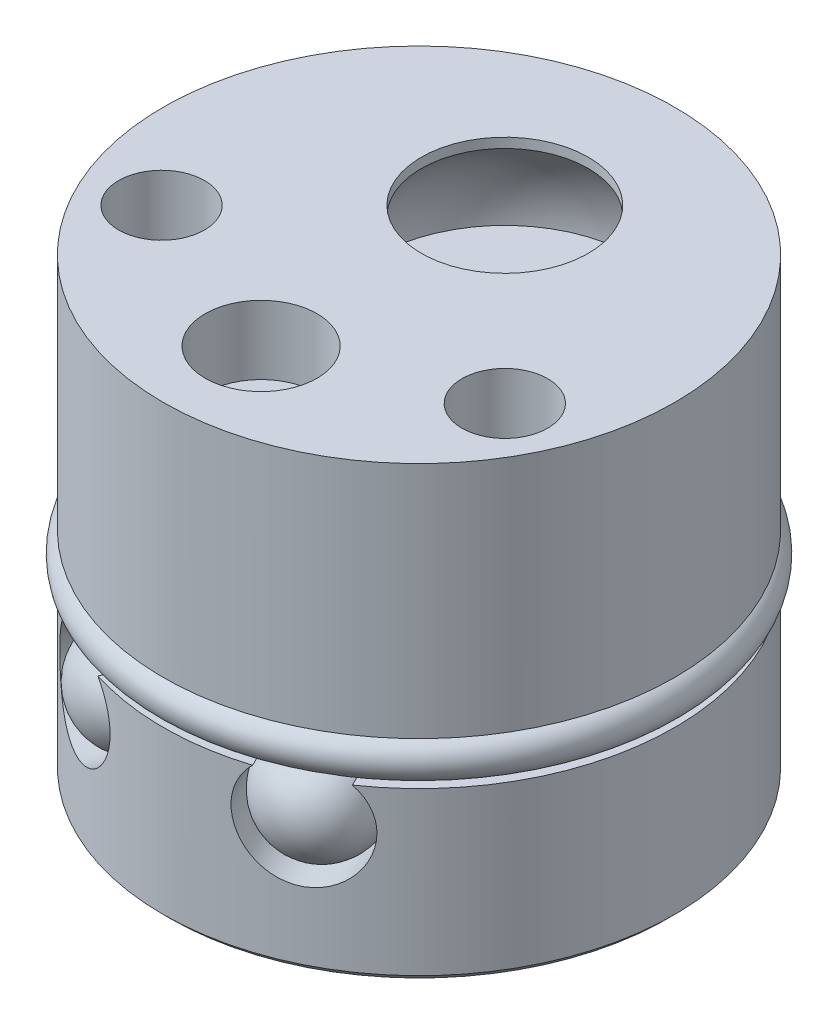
ISO-10303-21;
HEADER;
FILE_DESCRIPTION(('STEP AP214'),'2;1');
FILE_NAME('part.step','',(''),(''),'','','');
FILE_SCHEMA(('AUTOMOTIVE_DESIGN { 1 0 10303 214 1 1 1 1 }'));
ENDSEC;
DATA;
#1=APPLICATION_CONTEXT('core data for automotive mechanical design processes');
#2=APPLICATION_PROTOCOL_DEFINITION('international standard','automotive_design',2000,#1);
#3=PRODUCT_CONTEXT('',#1,'mechanical');
#4=PRODUCT('Part','Part','',(#3));
#5=PRODUCT_RELATED_PRODUCT_CATEGORY('part','',(#4));
#6=PRODUCT_DEFINITION_FORMATION('','',#4);
#7=PRODUCT_DEFINITION_CONTEXT('part definition',#1,'design');
#8=PRODUCT_DEFINITION('design','',#6,#7);
#9=PRODUCT_DEFINITION_SHAPE('','',#8);
#10=(LENGTH_UNIT() NAMED_UNIT(*) SI_UNIT(.MILLI.,.METRE.));
#11=(NAMED_UNIT(*) PLANE_ANGLE_UNIT() SI_UNIT($,.RADIAN.));
#12=(NAMED_UNIT(*) SI_UNIT($,.STERADIAN.) SOLID_ANGLE_UNIT());
#13=UNCERTAINTY_MEASURE_WITH_UNIT(LENGTH_MEASURE(1.E-05),#10,'distance_accuracy_value','');
#14=(GEOMETRIC_REPRESENTATION_CONTEXT(3) GLOBAL_UNCERTAINTY_ASSIGNED_CONTEXT((#13)) GLOBAL_UNIT_ASSIGNED_CONTEXT((#10,
#11,#12)) REPRESENTATION_CONTEXT('',''));
#15=CARTESIAN_POINT('',(0.,0.,0.));
#16=DIRECTION('',(0.,0.,1.));
#17=DIRECTION('',(1.,0.,0.));
#18=AXIS2_PLACEMENT_3D('',#15,#16,#17);
#19=CARTESIAN_POINT('',(3.4238978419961,4.7752,7.02003089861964));
#20=DIRECTION('',(0.,-1.,0.));
#21=DIRECTION('',(0.898794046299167,0.,-0.438371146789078));
#22=AXIS2_PLACEMENT_3D('',#19,#20,#21);
#23=SPHERICAL_SURFACE('',#22,1.9812);
#24=CARTESIAN_POINT('',(3.4238978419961,2.794,7.02003089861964));
#25=VERTEX_POINT('',#24);
#26=VERTEX_LOOP('',#25);
#27=FACE_BOUND('',#26,.T.);
#28=ADVANCED_FACE('F35',(#27),#23,.T.);
#29=CLOSED_SHELL('',(#28));
#30=MANIFOLD_SOLID_BREP('B2',#29);
#31=CARTESIAN_POINT('',(-3.4238978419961,4.7752,7.02003089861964));
#32=DIRECTION('',(0.,-1.,0.));
#33=DIRECTION('',(0.898794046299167,0.,0.438371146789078));
#34=AXIS2_PLACEMENT_3D('',#31,#32,#33);
#35=SPHERICAL_SURFACE('',#34,1.9812);
#36=CARTESIAN_POINT('',(-3.42389784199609,2.794,7.02003089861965));
#37=VERTEX_POINT('',#36);
#38=VERTEX_LOOP('',#37);
#39=FACE_BOUND('',#38,.T.);
#40=ADVANCED_FACE('F57',(#39),#35,.T.);
#41=CLOSED_SHELL('',(#40));
#42=MANIFOLD_SOLID_BREP('B6',#41);
#43=CARTESIAN_POINT('',(0.,7.09929999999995,0.));
#44=DIRECTION('',(0.,-1.,0.));
#45=DIRECTION('',(1.,0.,0.));
#46=AXIS2_PLACEMENT_3D('',#43,#44,#45);
#47=TOROIDAL_SURFACE('',#46,9.00430000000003,0.7493);
#48=CARTESIAN_POINT('',(5.96278342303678,6.76447314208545,7.61863946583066));
#49=CARTESIAN_POINT('',(5.9280526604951,6.7483945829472,7.63557879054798));
#50=CARTESIAN_POINT('',(5.89280266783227,6.73382605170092,7.65277136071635));
#51=CARTESIAN_POINT('',(5.82160339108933,6.70715050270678,7.6874975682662));
#52=CARTESIAN_POINT('',(5.78565508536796,6.69504027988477,7.70503072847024));
#53=CARTESIAN_POINT('',(5.71343440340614,6.67272341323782,7.74025510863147));
#54=CARTESIAN_POINT('',(5.67716363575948,6.66251014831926,7.75794554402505));
#55=CARTESIAN_POINT('',(5.60429250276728,6.64359766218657,7.79348717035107));
#56=CARTESIAN_POINT('',(5.56769201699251,6.63489901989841,7.81133842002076));
#57=CARTESIAN_POINT('',(5.45747356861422,6.61065775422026,7.86509554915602));
#58=CARTESIAN_POINT('',(5.38352254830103,6.59699426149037,7.90116387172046));
#59=CARTESIAN_POINT('',(5.23508435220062,6.57330401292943,7.97356201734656));
#60=CARTESIAN_POINT('',(5.16059664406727,6.56328159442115,8.00989210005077));
#61=CARTESIAN_POINT('',(5.00748954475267,6.54562682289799,8.0845674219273));
#62=CARTESIAN_POINT('',(4.92885629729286,6.53814545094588,8.12291941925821));
#63=CARTESIAN_POINT('',(4.77142694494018,6.52571117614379,8.19970284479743));
#64=CARTESIAN_POINT('',(4.69263082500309,6.52075851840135,8.23813428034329));
#65=CARTESIAN_POINT('',(4.45614158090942,6.50908324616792,8.35347779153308));
#66=CARTESIAN_POINT('',(4.29831999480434,6.5055404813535,8.43045252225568));
#67=CARTESIAN_POINT('',(3.98269674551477,6.50576747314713,8.58439226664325));
#68=CARTESIAN_POINT('',(3.82489508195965,6.50953647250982,8.66135728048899));
#69=CARTESIAN_POINT('',(3.58844697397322,6.5216018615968,8.77668072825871));
#70=CARTESIAN_POINT('',(3.5096668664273,6.52669298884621,8.81510435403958));
#71=CARTESIAN_POINT('',(3.3522755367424,6.53943295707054,8.89186923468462));
#72=CARTESIAN_POINT('',(3.27366429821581,6.54708153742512,8.93021049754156));
#73=CARTESIAN_POINT('',(3.12178499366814,6.5649691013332,9.00428698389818));
#74=CARTESIAN_POINT('',(3.04849834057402,6.5750099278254,9.0400312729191));
#75=CARTESIAN_POINT('',(2.90245870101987,6.59867105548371,9.11125956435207));
#76=CARTESIAN_POINT('',(2.82970519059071,6.6122871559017,9.14674382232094));
#77=CARTESIAN_POINT('',(2.72126878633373,6.63638180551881,9.19963179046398));
#78=CARTESIAN_POINT('',(2.68525627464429,6.64502002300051,9.21719626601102));
#79=CARTESIAN_POINT('',(2.61355606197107,6.66377839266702,9.25216679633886));
#80=CARTESIAN_POINT('',(2.57786824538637,6.67389799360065,9.26957290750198));
#81=CARTESIAN_POINT('',(2.5068097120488,6.69598248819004,9.3042304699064));
#82=CARTESIAN_POINT('',(2.4714405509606,6.70795374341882,9.32148116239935));
#83=CARTESIAN_POINT('',(2.40138328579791,6.73428392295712,9.35565037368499));
#84=CARTESIAN_POINT('',(2.36669611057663,6.74864588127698,9.37256843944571));
#85=CARTESIAN_POINT('',(2.33251378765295,6.76447314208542,9.38924027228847));
#86=B_SPLINE_CURVE_WITH_KNOTS('',3,(#48,#49,#50,#51,#52,#53,#54,#55,#56,#57,#58,#59,#60,#61,#62,
#63,#64,#65,#66,#67,#68,#69,#70,#71,#72,#73,#74,#75,#76,#77,#78,#79,#80,#81,#82,#83,#84,#85),
.UNSPECIFIED.,.F.,.F.,(4,2,2,2,2,2,2,2,2,2,2,2,2,2,2,2,2,2,4),(0.,0.125461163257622,
0.250757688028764,0.375608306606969,0.500506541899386,0.750592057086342,1.00097450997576,
1.2643474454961,1.52774590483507,2.05445048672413,2.58110052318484,2.84446887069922,
3.10781038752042,3.35422117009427,3.60034371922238,3.72328569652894,3.84618204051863,
3.9695103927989,4.09299646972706),.UNSPECIFIED.);
#87=CARTESIAN_POINT('',(5.01790990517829,6.54722028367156,8.07948507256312));
#88=VERTEX_POINT('',#87);
#89=CARTESIAN_POINT('',(3.27738730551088,6.54722028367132,8.9283946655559));
#90=VERTEX_POINT('',#89);
#91=EDGE_CURVE('E95',#88,#90,#86,.T.);
#92=ORIENTED_EDGE('',*,*,#91,.F.);
#93=CARTESIAN_POINT('',(2.71717337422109,6.37626922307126,8.37803131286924));
#94=CARTESIAN_POINT('',(2.71408483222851,6.38445993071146,8.34738835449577));
#95=CARTESIAN_POINT('',(2.71385410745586,6.39441606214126,8.31687072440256));
#96=CARTESIAN_POINT('',(2.71900537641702,6.4168939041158,8.25724968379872));
#97=CARTESIAN_POINT('',(2.72440629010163,6.42942414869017,8.2281513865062));
#98=CARTESIAN_POINT('',(2.74012105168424,6.45575869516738,8.17241479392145));
#99=CARTESIAN_POINT('',(2.75037666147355,6.46954636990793,8.14575169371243));
#100=CARTESIAN_POINT('',(2.77495310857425,6.49757317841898,8.09469780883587));
#101=CARTESIAN_POINT('',(2.78927289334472,6.51181219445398,8.07030643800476));
#102=CARTESIAN_POINT('',(2.83179089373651,6.54943994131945,8.00810571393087));
#103=CARTESIAN_POINT('',(2.86288529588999,6.57261561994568,7.97216136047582));
#104=CARTESIAN_POINT('',(2.93116503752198,6.61642261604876,7.90473041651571));
#105=CARTESIAN_POINT('',(2.96837309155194,6.63704392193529,7.87326129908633));
#106=CARTESIAN_POINT('',(3.0415010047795,6.67228537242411,7.81752613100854));
#107=CARTESIAN_POINT('',(3.07691593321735,6.68733988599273,7.79286129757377));
#108=CARTESIAN_POINT('',(3.14989474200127,6.71462389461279,7.74516725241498));
#109=CARTESIAN_POINT('',(3.18746012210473,6.72685138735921,7.72213920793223));
#110=CARTESIAN_POINT('',(3.26409535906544,6.74833905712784,7.67719265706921));
#111=CARTESIAN_POINT('',(3.30316605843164,6.75759754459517,7.65527478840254));
#112=CARTESIAN_POINT('',(3.38232152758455,6.7730671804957,7.61220549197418));
#113=CARTESIAN_POINT('',(3.42240640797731,6.77927799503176,7.59105414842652));
#114=CARTESIAN_POINT('',(3.50576623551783,6.78890550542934,7.54801076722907));
#115=CARTESIAN_POINT('',(3.54908339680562,6.79212217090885,7.52615566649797));
#116=CARTESIAN_POINT('',(3.63613384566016,6.79504781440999,7.48303349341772));
#117=CARTESIAN_POINT('',(3.67986719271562,6.79475628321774,7.46176650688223));
#118=CARTESIAN_POINT('',(3.76751095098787,6.79066664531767,7.41995697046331));
#119=CARTESIAN_POINT('',(3.81142134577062,6.78686885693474,7.39941435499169));
#120=CARTESIAN_POINT('',(3.89927218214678,6.77579119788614,7.35937305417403));
#121=CARTESIAN_POINT('',(3.94321261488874,6.76851210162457,7.33987413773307));
#122=CARTESIAN_POINT('',(4.02149718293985,6.75248578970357,7.30652657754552));
#123=CARTESIAN_POINT('',(4.05584810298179,6.74440308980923,7.2923719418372));
#124=CARTESIAN_POINT('',(4.12452621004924,6.72618809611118,7.26539151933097));
#125=CARTESIAN_POINT('',(4.15885340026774,6.71605617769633,7.25256548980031));
#126=CARTESIAN_POINT('',(4.22744529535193,6.6938368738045,7.22873510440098));
#127=CARTESIAN_POINT('',(4.26171000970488,6.68175274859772,7.21772777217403));
#128=CARTESIAN_POINT('',(4.3302260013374,6.65575865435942,7.19813704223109));
#129=CARTESIAN_POINT('',(4.3644772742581,6.64184979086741,7.18955218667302));
#130=CARTESIAN_POINT('',(4.43745142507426,6.6105082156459,7.17468245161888));
#131=CARTESIAN_POINT('',(4.4761738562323,6.59285252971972,7.16884461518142));
#132=CARTESIAN_POINT('',(4.55341433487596,6.55612714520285,7.16277732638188));
#133=CARTESIAN_POINT('',(4.59193258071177,6.53705928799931,7.1625406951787));
#134=CARTESIAN_POINT('',(4.65950321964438,6.50307955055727,7.16865383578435));
#135=CARTESIAN_POINT('',(4.68870541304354,6.48821473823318,7.17350936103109));
#136=CARTESIAN_POINT('',(4.7461485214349,6.45921711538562,7.188410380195));
#137=CARTESIAN_POINT('',(4.77439082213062,6.44508323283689,7.19844802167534));
#138=CARTESIAN_POINT('',(4.82409126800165,6.42109676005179,7.22182795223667));
#139=CARTESIAN_POINT('',(4.8458423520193,6.41093471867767,7.23422395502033));
#140=CARTESIAN_POINT('',(4.88763052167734,6.39250853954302,7.26276921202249));
#141=CARTESIAN_POINT('',(4.90766837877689,6.38424354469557,7.27891676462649));
#142=CARTESIAN_POINT('',(4.94552596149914,6.37016181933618,7.31467038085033));
#143=CARTESIAN_POINT('',(4.96333815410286,6.36435325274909,7.33428767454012));
#144=CARTESIAN_POINT('',(4.99617862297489,6.35558726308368,7.37629600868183));
#145=CARTESIAN_POINT('',(5.01120650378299,6.35263024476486,7.39868744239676));
#146=CARTESIAN_POINT('',(5.03744030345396,6.34973150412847,7.44422169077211));
#147=CARTESIAN_POINT('',(5.04880424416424,6.34964108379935,7.46726500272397));
#148=CARTESIAN_POINT('',(5.06859060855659,6.35196593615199,7.5144500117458));
#149=CARTESIAN_POINT('',(5.0770127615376,6.35438143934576,7.53859180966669));
#150=CARTESIAN_POINT('',(5.0914077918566,6.36171374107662,7.58921713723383));
#151=CARTESIAN_POINT('',(5.09714962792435,6.36680453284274,7.6157405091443));
#152=CARTESIAN_POINT('',(5.10527986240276,6.37913070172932,7.66879419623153));
#153=CARTESIAN_POINT('',(5.10766628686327,6.38636733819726,7.69532450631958));
#154=CARTESIAN_POINT('',(5.1095581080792,6.40591252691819,7.75904646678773));
#155=CARTESIAN_POINT('',(5.10742951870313,6.41907412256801,7.79602881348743));
#156=CARTESIAN_POINT('',(5.09729063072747,6.44745081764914,7.86835940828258));
#157=CARTESIAN_POINT('',(5.08926993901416,6.46266950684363,7.90370465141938));
#158=CARTESIAN_POINT('',(5.06450982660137,6.49918944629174,7.98374732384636));
#159=CARTESIAN_POINT('',(5.04576225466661,6.52083546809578,8.02766371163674));
#160=CARTESIAN_POINT('',(5.00074376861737,6.56359774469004,8.11169169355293));
#161=CARTESIAN_POINT('',(4.97446229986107,6.58471321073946,8.15179784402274));
#162=CARTESIAN_POINT('',(4.90453418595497,6.63279691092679,8.24336328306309));
#163=CARTESIAN_POINT('',(4.85810878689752,6.65884885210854,8.29317415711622));
#164=CARTESIAN_POINT('',(4.75711826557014,6.70487284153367,8.38703169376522));
#165=CARTESIAN_POINT('',(4.70253912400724,6.72483423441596,8.43106817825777));
#166=CARTESIAN_POINT('',(4.60892994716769,6.75154198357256,8.4989505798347));
#167=CARTESIAN_POINT('',(4.5715480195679,6.76044947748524,8.52427351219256));
#168=CARTESIAN_POINT('',(4.49502932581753,6.77524783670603,8.57311448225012));
#169=CARTESIAN_POINT('',(4.45589212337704,6.7811379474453,8.59663206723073));
#170=CARTESIAN_POINT('',(4.37625633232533,6.78981275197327,8.64192856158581));
#171=CARTESIAN_POINT('',(4.33575675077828,6.79259512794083,8.66370616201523));
#172=CARTESIAN_POINT('',(4.25374969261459,6.79501214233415,8.70546484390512));
#173=CARTESIAN_POINT('',(4.21224220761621,6.79464675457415,8.72544591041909));
#174=CARTESIAN_POINT('',(4.12819605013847,6.79075869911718,8.76359725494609));
#175=CARTESIAN_POINT('',(4.08565219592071,6.78721396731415,8.78175389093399));
#176=CARTESIAN_POINT('',(4.00006820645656,6.77698678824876,8.8158187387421));
#177=CARTESIAN_POINT('',(3.95702834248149,6.77030598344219,8.83172812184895));
#178=CARTESIAN_POINT('',(3.87067199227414,6.75391389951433,8.86090207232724));
#179=CARTESIAN_POINT('',(3.82735582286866,6.7442056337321,8.87416924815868));
#180=CARTESIAN_POINT('',(3.74062446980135,6.72193923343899,8.89754357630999));
#181=CARTESIAN_POINT('',(3.69720934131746,6.70938242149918,8.9076521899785));
#182=CARTESIAN_POINT('',(3.59524942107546,6.67683059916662,8.92694001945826));
#183=CARTESIAN_POINT('',(3.53673113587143,6.65577074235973,8.93455378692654));
#184=CARTESIAN_POINT('',(3.42060307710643,6.61012920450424,8.94080233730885));
#185=CARTESIAN_POINT('',(3.36299191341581,6.58555364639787,8.93945254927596));
#186=CARTESIAN_POINT('',(3.2644035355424,6.54151666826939,8.92730765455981));
#187=CARTESIAN_POINT('',(3.22297651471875,6.52237564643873,8.91904463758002));
#188=CARTESIAN_POINT('',(3.14192115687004,6.48461084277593,8.89541264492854));
#189=CARTESIAN_POINT('',(3.10229070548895,6.4659864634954,8.88005227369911));
#190=CARTESIAN_POINT('',(3.034436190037,6.43490943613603,8.84588644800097));
#191=CARTESIAN_POINT('',(3.00564442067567,6.42200841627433,8.82862150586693));
#192=CARTESIAN_POINT('',(2.95045362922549,6.39854694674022,8.78931371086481));
#193=CARTESIAN_POINT('',(2.92405183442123,6.3879837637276,8.76727649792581));
#194=CARTESIAN_POINT('',(2.87881884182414,6.37178386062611,8.72285230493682));
#195=CARTESIAN_POINT('',(2.85946920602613,6.36561013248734,8.70119091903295));
#196=CARTESIAN_POINT('',(2.82359268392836,6.35613597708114,8.65504464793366));
#197=CARTESIAN_POINT('',(2.80706586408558,6.35283561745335,8.63055969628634));
#198=CARTESIAN_POINT('',(2.77742130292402,6.34954864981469,8.57914166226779));
#199=CARTESIAN_POINT('',(2.7643293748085,6.34958645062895,8.55219198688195));
#200=CARTESIAN_POINT('',(2.74244432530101,6.35325670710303,8.49686612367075));
#201=CARTESIAN_POINT('',(2.73364030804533,6.35687997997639,8.4684937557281));
#202=CARTESIAN_POINT('',(2.72493182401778,6.36411801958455,8.42964884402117));
#203=CARTESIAN_POINT('',(2.72293575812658,6.36625807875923,8.41932606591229));
#204=CARTESIAN_POINT('',(2.71957639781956,6.37095520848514,8.39867456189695));
#205=CARTESIAN_POINT('',(2.71821298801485,6.37351220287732,8.38834583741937));
#206=CARTESIAN_POINT('',(2.71717337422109,6.37626922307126,8.37803131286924));
#207=B_SPLINE_CURVE_WITH_KNOTS('',3,(#93,#94,#95,#96,#97,#98,#99,#100,#101,#102,#103,#104,#105,
#106,#107,#108,#109,#110,#111,#112,#113,#114,#115,#116,#117,#118,#119,#120,#121,#122,#123,#124,
#125,#126,#127,#128,#129,#130,#131,#132,#133,#134,#135,#136,#137,#138,#139,#140,#141,#142,#143,
#144,#145,#146,#147,#148,#149,#150,#151,#152,#153,#154,#155,#156,#157,#158,#159,#160,#161,#162,
#163,#164,#165,#166,#167,#168,#169,#170,#171,#172,#173,#174,#175,#176,#177,#178,#179,#180,#181,
#182,#183,#184,#185,#186,#187,#188,#189,#190,#191,#192,#193,#194,#195,#196,#197,#198,#199,#200,
#201,#202,#203,#204,#205,#206),.UNSPECIFIED.,.T.,.F.,(4,2,2,2,2,2,2,2,2,2,2,2,2,2,2,2,2,2,2,2,2,
2,2,2,2,2,2,2,2,2,2,2,2,2,2,2,2,2,2,2,2,2,2,2,2,2,2,2,2,2,2,2,2,2,2,2,4),(0.,0.0955488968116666,
0.191419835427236,0.286168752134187,0.380893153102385,0.538616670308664,0.696940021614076,
0.833876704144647,0.970910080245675,1.10802129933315,1.24514753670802,1.39088780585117,
1.53664922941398,1.68239742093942,1.82811320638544,1.94210899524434,2.05608392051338,
2.16987043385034,2.28358832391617,2.41216377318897,2.54057442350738,2.6396113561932,
2.73849865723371,2.81921335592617,2.89989151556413,2.98083574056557,3.06179145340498,
3.13854050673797,3.2152966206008,3.29780884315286,3.38036958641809,3.49765634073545,
3.61515047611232,3.77156989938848,3.92820953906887,4.14574949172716,4.36366787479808,
4.50157981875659,4.63952623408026,4.77757546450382,4.91562584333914,5.05464174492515,
5.19358492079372,5.33239024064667,5.47113124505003,5.65846372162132,5.84547382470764,
5.98413667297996,6.12263185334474,6.23012971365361,6.33750121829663,6.42622310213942,
6.51494707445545,6.60431985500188,6.69346433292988,6.72563228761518,6.75779437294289),.UNSPECIFIED.);
#208=EDGE_CURVE('E109',#90,#88,#207,.T.);
#209=ORIENTED_EDGE('',*,*,#208,.F.);
#210=EDGE_LOOP('',(#92,#209));
#211=FACE_BOUND('',#210,.T.);
#212=CARTESIAN_POINT('',(-2.33251378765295,6.76447314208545,9.38924027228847));
#213=CARTESIAN_POINT('',(-2.36724455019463,6.7483945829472,9.37230094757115));
#214=CARTESIAN_POINT('',(-2.40249454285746,6.73382605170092,9.35510837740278));
#215=CARTESIAN_POINT('',(-2.4736938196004,6.70715050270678,9.32038216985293));
#216=CARTESIAN_POINT('',(-2.50964212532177,6.69504027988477,9.30284900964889));
#217=CARTESIAN_POINT('',(-2.58186280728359,6.67272341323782,9.26762462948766));
#218=CARTESIAN_POINT('',(-2.61813357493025,6.66251014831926,9.24993419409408));
#219=CARTESIAN_POINT('',(-2.69100470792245,6.64359766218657,9.21439256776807));
#220=CARTESIAN_POINT('',(-2.72760519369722,6.63489901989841,9.19654131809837));
#221=CARTESIAN_POINT('',(-2.83782364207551,6.61065775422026,9.14278418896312));
#222=CARTESIAN_POINT('',(-2.9117746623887,6.59699426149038,9.10671586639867));
#223=CARTESIAN_POINT('',(-3.06021285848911,6.57330401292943,9.03431772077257));
#224=CARTESIAN_POINT('',(-3.13470056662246,6.56328159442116,8.99798763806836));
#225=CARTESIAN_POINT('',(-3.28780766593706,6.54562682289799,8.92331231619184));
#226=CARTESIAN_POINT('',(-3.36644091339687,6.53814545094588,8.88496031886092));
#227=CARTESIAN_POINT('',(-3.52387026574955,6.52571117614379,8.80817689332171));
#228=CARTESIAN_POINT('',(-3.60266638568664,6.52075851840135,8.76974545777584));
#229=CARTESIAN_POINT('',(-3.83915562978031,6.50908324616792,8.65440194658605));
#230=CARTESIAN_POINT('',(-3.99697721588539,6.5055404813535,8.57742721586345));
#231=CARTESIAN_POINT('',(-4.31260046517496,6.50576747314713,8.42348747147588));
#232=CARTESIAN_POINT('',(-4.47040212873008,6.50953647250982,8.34652245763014));
#233=CARTESIAN_POINT('',(-4.70685023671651,6.5216018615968,8.23119900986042));
#234=CARTESIAN_POINT('',(-4.78563034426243,6.52669298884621,8.19277538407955));
#235=CARTESIAN_POINT('',(-4.94302167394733,6.53943295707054,8.11601050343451));
#236=CARTESIAN_POINT('',(-5.02163291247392,6.54708153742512,8.07766924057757));
#237=CARTESIAN_POINT('',(-5.17351221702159,6.5649691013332,8.00359275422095));
#238=CARTESIAN_POINT('',(-5.24679887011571,6.5750099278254,7.96784846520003));
#239=CARTESIAN_POINT('',(-5.39283850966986,6.59867105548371,7.89662017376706));
#240=CARTESIAN_POINT('',(-5.46559202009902,6.6122871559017,7.86113591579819));
#241=CARTESIAN_POINT('',(-5.574028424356,6.63638180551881,7.80824794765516));
#242=CARTESIAN_POINT('',(-5.61004093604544,6.64502002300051,7.79068347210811));
#243=CARTESIAN_POINT('',(-5.68174114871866,6.66377839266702,7.75571294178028));
#244=CARTESIAN_POINT('',(-5.71742896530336,6.67389799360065,7.73830683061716));
#245=CARTESIAN_POINT('',(-5.78848749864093,6.69598248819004,7.70364926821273));
#246=CARTESIAN_POINT('',(-5.82385665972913,6.70795374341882,7.68639857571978));
#247=CARTESIAN_POINT('',(-5.89391392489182,6.73428392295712,7.65222936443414));
#248=CARTESIAN_POINT('',(-5.9286011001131,6.74864588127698,7.63531129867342));
#249=CARTESIAN_POINT('',(-5.96278342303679,6.76447314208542,7.61863946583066));
#250=B_SPLINE_CURVE_WITH_KNOTS('',3,(#212,#213,#214,#215,#216,#217,#218,#219,#220,#221,#222,
#223,#224,#225,#226,#227,#228,#229,#230,#231,#232,#233,#234,#235,#236,#237,#238,#239,#240,#241,
#242,#243,#244,#245,#246,#247,#248,#249),.UNSPECIFIED.,.F.,.F.,(4,2,2,2,2,2,2,2,2,2,2,2,2,2,2,2,
2,2,4),(0.,0.125461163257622,0.250757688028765,0.375608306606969,0.500506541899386,
0.750592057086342,1.00097450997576,1.2643474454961,1.52774590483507,2.05445048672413,
2.58110052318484,2.84446887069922,3.10781038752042,3.35422117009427,3.60034371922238,
3.72328569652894,3.84618204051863,3.9695103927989,4.09299646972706),.UNSPECIFIED.);
#251=CARTESIAN_POINT('',(-3.27738730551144,6.54722028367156,8.92839466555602));
#252=VERTEX_POINT('',#251);
#253=CARTESIAN_POINT('',(-5.01790990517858,6.54722028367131,8.07948507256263));
#254=VERTEX_POINT('',#253);
#255=EDGE_CURVE('E55',#252,#254,#250,.T.);
#256=ORIENTED_EDGE('',*,*,#255,.F.);
#257=CARTESIAN_POINT('',(-4.92911980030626,6.37626922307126,7.29919295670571));
#258=CARTESIAN_POINT('',(-4.90687431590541,6.38445993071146,7.27789346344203));
#259=CARTESIAN_POINT('',(-4.88296814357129,6.39441606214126,7.25892312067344));
#260=CARTESIAN_POINT('',(-4.83281468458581,6.4168939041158,7.22627599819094));
#261=CARTESIAN_POINT('',(-4.80655977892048,6.42942414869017,7.21261727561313));
#262=CARTESIAN_POINT('',(-4.75296377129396,6.45575869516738,7.19068580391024));
#263=CARTESIAN_POINT('',(-4.72563897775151,6.46954636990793,7.18235189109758));
#264=CARTESIAN_POINT('',(-4.67027719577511,6.49757317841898,7.17028648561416));
#265=CARTESIAN_POINT('',(-4.64224039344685,6.51181219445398,7.16655380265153));
#266=CARTESIAN_POINT('',(-4.56704885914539,6.54943994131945,7.16176385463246));
#267=CARTESIAN_POINT('',(-4.51958069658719,6.57261561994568,7.16413702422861));
#268=CARTESIAN_POINT('',(-4.42440718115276,6.61642261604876,7.17642756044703));
#269=CARTESIAN_POINT('',(-4.37670161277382,6.63704392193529,7.18637358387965));
#270=CARTESIAN_POINT('',(-4.28775966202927,6.67228537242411,7.20968517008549));
#271=CARTESIAN_POINT('',(-4.24651990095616,6.68733988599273,7.22240732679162));
#272=CARTESIAN_POINT('',(-4.16400623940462,6.71462389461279,7.25055202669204));
#273=CARTESIAN_POINT('',(-4.12273233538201,6.72685138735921,7.26597647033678));
#274=CARTESIAN_POINT('',(-4.04013260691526,6.74833905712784,7.29869400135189));
#275=CARTESIAN_POINT('',(-3.99880676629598,6.75759754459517,7.31598814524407));
#276=CARTESIAN_POINT('',(-3.91613472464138,6.7730671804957,7.35184739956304));
#277=CARTESIAN_POINT('',(-3.87478852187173,6.77927799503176,7.37041264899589));
#278=CARTESIAN_POINT('',(-3.78954844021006,6.78890550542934,7.4096009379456));
#279=CARTESIAN_POINT('',(-3.74565767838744,6.79212217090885,7.4302799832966));
#280=CARTESIAN_POINT('',(-3.65808333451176,6.79504781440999,7.47232801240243));
#281=CARTESIAN_POINT('',(-3.6143997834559,6.79475628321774,7.49369709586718));
#282=CARTESIAN_POINT('',(-3.52749453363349,6.79066664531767,7.53702079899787));
#283=CARTESIAN_POINT('',(-3.48427279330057,6.78686885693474,7.55897536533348));
#284=CARTESIAN_POINT('',(-3.39863344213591,6.77579119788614,7.60355088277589));
#285=CARTESIAN_POINT('',(-3.35621565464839,6.76851210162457,7.62617168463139));
#286=CARTESIAN_POINT('',(-3.28174062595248,6.75248578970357,7.66732995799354));
#287=CARTESIAN_POINT('',(-3.24943808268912,6.74440308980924,7.68568438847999));
#288=CARTESIAN_POINT('',(-3.18589475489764,6.72618809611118,7.7231926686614));
#289=CARTESIAN_POINT('',(-3.1546537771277,6.71605617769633,7.74234637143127));
#290=CARTESIAN_POINT('',(-3.09364578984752,6.6938368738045,7.78172607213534));
#291=CARTESIAN_POINT('',(-3.06387642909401,6.68175274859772,7.80195024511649));
#292=CARTESIAN_POINT('',(-3.00625606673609,6.65575865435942,7.84388032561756));
#293=CARTESIAN_POINT('',(-2.97840391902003,6.64184979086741,7.86558533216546));
#294=CARTESIAN_POINT('',(-2.92175903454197,6.6105082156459,7.91393502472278));
#295=CARTESIAN_POINT('',(-2.8933188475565,6.59285252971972,7.94085458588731));
#296=CARTESIAN_POINT('',(-2.84098377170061,6.55612714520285,7.99798551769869));
#297=CARTESIAN_POINT('',(-2.81708310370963,6.53705928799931,8.02819262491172));
#298=CARTESIAN_POINT('',(-2.78029968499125,6.50307955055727,8.08520264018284));
#299=CARTESIAN_POINT('',(-2.76614722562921,6.48821473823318,8.11120364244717));
#300=CARTESIAN_POINT('',(-2.74252388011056,6.45921711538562,8.16564341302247));
#301=CARTESIAN_POINT('',(-2.733045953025,6.44508323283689,8.19407843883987));
#302=CARTESIAN_POINT('',(-2.72087093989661,6.42109676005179,8.24763704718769));
#303=CARTESIAN_POINT('',(-2.71724781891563,6.41093471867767,8.27240887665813));
#304=CARTESIAN_POINT('',(-2.71401442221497,6.39250853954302,8.3229126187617));
#305=CARTESIAN_POINT('',(-2.71440233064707,6.38424354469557,8.34864409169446));
#306=CARTESIAN_POINT('',(-2.71926910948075,6.37016181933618,8.40048839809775));
#307=CARTESIAN_POINT('',(-2.72376146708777,6.36435325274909,8.42660220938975));
#308=CARTESIAN_POINT('',(-2.7366458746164,6.35558726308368,8.47834376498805));
#309=CARTESIAN_POINT('',(-2.74503847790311,6.35263024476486,8.50397143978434));
#310=CARTESIAN_POINT('',(-2.76476881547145,6.34973150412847,8.55267763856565));
#311=CARTESIAN_POINT('',(-2.77593085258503,6.34964108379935,8.57581942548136));
#312=CARTESIAN_POINT('',(-2.80093144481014,6.35196593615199,8.62046128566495));
#313=CARTESIAN_POINT('',(-2.81477024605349,6.35438143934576,8.6419612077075));
#314=CARTESIAN_POINT('',(-2.84580108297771,6.36171374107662,8.6844727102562));
#315=CARTESIAN_POINT('',(-2.86316675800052,6.36680453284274,8.70532675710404));
#316=CARTESIAN_POINT('',(-2.89996816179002,6.37913070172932,8.74439658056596));
#317=CARTESIAN_POINT('',(-2.91940510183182,6.38636733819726,8.76261079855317));
#318=CARTESIAN_POINT('',(-2.96845397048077,6.40591252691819,8.80333273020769));
#319=CARTESIAN_POINT('',(-2.99890694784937,6.41907412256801,8.82442398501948));
#320=CARTESIAN_POINT('',(-3.06214635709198,6.44745081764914,8.86096559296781));
#321=CARTESIAN_POINT('',(-3.09493681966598,6.46266950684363,8.8764059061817));
#322=CARTESIAN_POINT('',(-3.17325515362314,6.49918944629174,8.90617386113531));
#323=CARTESIAN_POINT('',(-3.21940389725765,6.52083546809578,8.9184382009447));
#324=CARTESIAN_POINT('',(-3.31333499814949,6.56359774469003,8.93469594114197));
#325=CARTESIAN_POINT('',(-3.3611195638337,6.58471321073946,8.9386776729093));
#326=CARTESIAN_POINT('',(-3.47632616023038,6.63279691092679,8.93994688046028));
#327=CARTESIAN_POINT('',(-3.5441599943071,6.65884885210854,8.93402980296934));
#328=CARTESIAN_POINT('',(-3.68029671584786,6.70487284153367,8.91223265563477));
#329=CARTESIAN_POINT('',(-3.74860021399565,6.72483423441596,8.89633527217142));
#330=CARTESIAN_POINT('',(-3.85972384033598,6.75154198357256,8.86436281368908));
#331=CARTESIAN_POINT('',(-3.90269319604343,6.76044947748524,8.85049580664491));
#332=CARTESIAN_POINT('',(-3.98829001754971,6.77524783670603,8.82026775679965));
#333=CARTESIAN_POINT('',(-4.03091739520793,6.7811379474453,8.80390609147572));
#334=CARTESIAN_POINT('',(-4.11564020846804,6.78981275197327,8.76903953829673));
#335=CARTESIAN_POINT('',(-4.1577352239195,6.79259512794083,8.75053306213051));
#336=CARTESIAN_POINT('',(-4.24113010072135,6.79501214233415,8.71161983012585));
#337=CARTESIAN_POINT('',(-4.28242995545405,6.79464675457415,8.69121305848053));
#338=CARTESIAN_POINT('',(-4.36423760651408,6.79075869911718,8.6484720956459));
#339=CARTESIAN_POINT('',(-4.40473784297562,6.78721396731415,8.62612542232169));
#340=CARTESIAN_POINT('',(-4.48427207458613,6.77698678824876,8.57965673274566));
#341=CARTESIAN_POINT('',(-4.52330682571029,6.77030598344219,8.55553565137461));
#342=CARTESIAN_POINT('',(-4.59946249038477,6.75391389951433,8.50544719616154));
#343=CARTESIAN_POINT('',(-4.63658526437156,6.7442056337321,8.47948167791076));
#344=CARTESIAN_POINT('',(-4.70840163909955,6.72193923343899,8.42552711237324));
#345=CARTESIAN_POINT('',(-4.74309635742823,6.70938242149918,8.39753900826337));
#346=CARTESIAN_POINT('',(-4.82106816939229,6.67683059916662,8.32906826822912));
#347=CARTESIAN_POINT('',(-4.863095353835,6.65577074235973,8.28764273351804));
#348=CARTESIAN_POINT('',(-4.93951485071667,6.61012920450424,8.19997956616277));
#349=CARTESIAN_POINT('',(-4.97392017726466,6.58555364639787,8.15375033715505));
#350=CARTESIAN_POINT('',(-5.02504693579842,6.54151666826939,8.06858449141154));
#351=CARTESIAN_POINT('',(-5.04404061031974,6.52237564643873,8.03085233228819));
#352=CARTESIAN_POINT('',(-5.07532100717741,6.48461084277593,7.95243053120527));
#353=CARTESIAN_POINT('',(-5.08761581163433,6.4659864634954,7.91174452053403));
#354=CARTESIAN_POINT('',(-5.102468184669,6.43490943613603,7.83723985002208));
#355=CARTESIAN_POINT('',(-5.10658920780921,6.42200841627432,7.80392226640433));
#356=CARTESIAN_POINT('',(-5.10959308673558,6.39854694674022,7.73623103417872));
#357=CARTESIAN_POINT('',(-5.10848209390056,6.3879837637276,7.70185867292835));
#358=CARTESIAN_POINT('',(-5.10132356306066,6.37178386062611,7.63886432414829));
#359=CARTESIAN_POINT('',(-5.0961669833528,6.36561013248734,7.6102805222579));
#360=CARTESIAN_POINT('',(-5.08189101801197,6.35613597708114,7.55359895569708));
#361=CARTESIAN_POINT('',(-5.07277153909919,6.35283561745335,7.52550120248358));
#362=CARTESIAN_POINT('',(-5.05050458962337,6.34954864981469,7.47048486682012));
#363=CARTESIAN_POINT('',(-5.03732815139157,6.34958645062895,7.44357640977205));
#364=CARTESIAN_POINT('',(-5.00720455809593,6.35325670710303,7.39226875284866));
#365=CARTESIAN_POINT('',(-4.99026712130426,6.35687997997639,7.36786331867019));
#366=CARTESIAN_POINT('',(-4.96501839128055,6.36411801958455,7.33708562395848));
#367=CARTESIAN_POINT('',(-4.95811283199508,6.36625807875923,7.32915736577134));
#368=CARTESIAN_POINT('',(-4.9439074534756,6.37095520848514,7.31379581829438));
#369=CARTESIAN_POINT('',(-4.93660770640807,6.37351220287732,7.3063624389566));
#370=CARTESIAN_POINT('',(-4.92911980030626,6.37626922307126,7.29919295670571));
#371=B_SPLINE_CURVE_WITH_KNOTS('',3,(#257,#258,#259,#260,#261,#262,#263,#264,#265,#266,#267,
#268,#269,#270,#271,#272,#273,#274,#275,#276,#277,#278,#279,#280,#281,#282,#283,#284,#285,#286,
#287,#288,#289,#290,#291,#292,#293,#294,#295,#296,#297,#298,#299,#300,#301,#302,#303,#304,#305,
#306,#307,#308,#309,#310,#311,#312,#313,#314,#315,#316,#317,#318,#319,#320,#321,#322,#323,#324,
#325,#326,#327,#328,#329,#330,#331,#332,#333,#334,#335,#336,#337,#338,#339,#340,#341,#342,#343,
#344,#345,#346,#347,#348,#349,#350,#351,#352,#353,#354,#355,#356,#357,#358,#359,#360,#361,#362,
#363,#364,#365,#366,#367,#368,#369,#370),.UNSPECIFIED.,.T.,.F.,(4,2,2,2,2,2,2,2,2,2,2,2,2,2,2,2,
2,2,2,2,2,2,2,2,2,2,2,2,2,2,2,2,2,2,2,2,2,2,2,2,2,2,2,2,2,2,2,2,2,2,2,2,2,2,2,2,4),(0.,
0.0955488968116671,0.191419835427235,0.286168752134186,0.380893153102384,0.538616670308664,
0.696940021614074,0.833876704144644,0.970910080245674,1.10802129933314,1.24514753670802,
1.39088780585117,1.53664922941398,1.68239742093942,1.82811320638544,1.94210899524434,
2.05608392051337,2.16987043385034,2.28358832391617,2.41216377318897,2.54057442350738,
2.63961135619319,2.73849865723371,2.81921335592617,2.89989151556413,2.98083574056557,
3.06179145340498,3.13854050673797,3.2152966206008,3.29780884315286,3.38036958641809,
3.49765634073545,3.61515047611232,3.77156989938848,3.92820953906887,4.14574949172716,
4.36366787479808,4.50157981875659,4.63952623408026,4.77757546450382,4.91562584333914,
5.05464174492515,5.19358492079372,5.33239024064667,5.47113124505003,5.65846372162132,
5.84547382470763,5.98413667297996,6.12263185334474,6.23012971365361,6.33750121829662,
6.42622310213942,6.51494707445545,6.60431985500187,6.69346433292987,6.72563228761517,
6.75779437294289),.UNSPECIFIED.);
#372=EDGE_CURVE('E89',#254,#252,#371,.T.);
#373=ORIENTED_EDGE('',*,*,#372,.F.);
#374=EDGE_LOOP('',(#256,#373));
#375=FACE_BOUND('',#374,.T.);
#376=ADVANCED_FACE('F78',(#211,#375),#47,.T.);
#377=CARTESIAN_POINT('',(-4.14764860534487,6.79450000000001,8.50393986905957));
#378=DIRECTION('',(-0.438371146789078,0.,0.898794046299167));
#379=DIRECTION('',(0.898794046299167,0.,0.438371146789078));
#380=AXIS2_PLACEMENT_3D('',#377,#378,#379);
#381=PLANE('',#380);
#382=ORIENTED_EDGE('',*,*,#255,.T.);
#383=CARTESIAN_POINT('',(-4.14764860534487,4.7752,8.50393986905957));
#384=DIRECTION('',(-0.438371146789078,0.,0.898794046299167));
#385=DIRECTION('',(0.898794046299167,0.,0.438371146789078));
#386=AXIS2_PLACEMENT_3D('',#383,#384,#385);
#387=CIRCLE('',#386,2.01930000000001);
#388=EDGE_CURVE('E102',#252,#254,#387,.T.);
#389=ORIENTED_EDGE('',*,*,#388,.F.);
#390=EDGE_LOOP('',(#382,#389));
#391=FACE_BOUND('',#390,.T.);
#392=ADVANCED_FACE('F137',(#391),#381,.F.);
#393=CARTESIAN_POINT('',(-4.14764860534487,4.7752,8.50393986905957));
#394=DIRECTION('',(-0.438371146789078,0.,0.898794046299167));
#395=DIRECTION('',(0.898794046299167,0.,0.438371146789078));
#396=AXIS2_PLACEMENT_3D('',#393,#394,#395);
#397=CYLINDRICAL_SURFACE('',#396,2.01930000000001);
#398=ORIENTED_EDGE('',*,*,#372,.T.);
#399=ORIENTED_EDGE('',*,*,#388,.T.);
#400=EDGE_LOOP('',(#398,#399));
#401=FACE_BOUND('',#400,.T.);
#402=ADVANCED_FACE('F129',(#401),#397,.F.);
#403=CARTESIAN_POINT('',(4.14764860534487,6.79450000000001,8.50393986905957));
#404=DIRECTION('',(0.438371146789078,0.,0.898794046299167));
#405=DIRECTION('',(0.898794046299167,0.,-0.438371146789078));
#406=AXIS2_PLACEMENT_3D('',#403,#404,#405);
#407=PLANE('',#406);
#408=ORIENTED_EDGE('',*,*,#91,.T.);
#409=CARTESIAN_POINT('',(4.14764860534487,4.7752,8.50393986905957));
#410=DIRECTION('',(0.438371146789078,0.,0.898794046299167));
#411=DIRECTION('',(0.898794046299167,0.,-0.438371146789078));
#412=AXIS2_PLACEMENT_3D('',#409,#410,#411);
#413=CIRCLE('',#412,2.01930000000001);
#414=EDGE_CURVE('E111',#88,#90,#413,.T.);
#415=ORIENTED_EDGE('',*,*,#414,.F.);
#416=EDGE_LOOP('',(#408,#415));
#417=FACE_BOUND('',#416,.T.);
#418=ADVANCED_FACE('F114',(#417),#407,.F.);
#419=CARTESIAN_POINT('',(4.14764860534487,4.7752,8.50393986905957));
#420=DIRECTION('',(0.438371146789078,0.,0.898794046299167));
#421=DIRECTION('',(0.898794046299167,0.,-0.438371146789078));
#422=AXIS2_PLACEMENT_3D('',#419,#420,#421);
#423=CYLINDRICAL_SURFACE('',#422,2.01930000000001);
#424=ORIENTED_EDGE('',*,*,#208,.T.);
#425=ORIENTED_EDGE('',*,*,#414,.T.);
#426=EDGE_LOOP('',(#424,#425));
#427=FACE_BOUND('',#426,.T.);
#428=ADVANCED_FACE('F110',(#427),#423,.F.);
#429=CLOSED_SHELL('',(#376,#392,#402,#418,#428));
#430=MANIFOLD_SOLID_BREP('B31',#429);
#431=CARTESIAN_POINT('',(9.4615,6.2484,0.));
#432=DIRECTION('',(0.,-1.,0.));
#433=DIRECTION('',(1.,0.,0.));
#434=AXIS2_PLACEMENT_3D('',#431,#432,#433);
#435=PLANE('',#434);
#436=CARTESIAN_POINT('',(0.,6.24840000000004,0.));
#437=DIRECTION('',(0.,-1.,0.));
#438=DIRECTION('',(1.,0.,0.));
#439=AXIS2_PLACEMENT_3D('',#436,#437,#438);
#440=CIRCLE('',#439,8.25500000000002);
#441=CARTESIAN_POINT('',(-4.80901821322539,6.24840000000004,6.70957292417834));
#442=VERTEX_POINT('',#441);
#443=CARTESIAN_POINT('',(4.80901821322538,6.24840000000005,6.70957292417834));
#444=VERTEX_POINT('',#443);
#445=EDGE_CURVE('E272',#442,#444,#440,.T.);
#446=ORIENTED_EDGE('',*,*,#445,.T.);
#447=DIRECTION('',(0.438371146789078,0.,0.898794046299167));
#448=VECTOR('',#447,1.);
#449=CARTESIAN_POINT('',(5.38891352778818,6.24839999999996,7.89853451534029));
#450=LINE('',#449,#448);
#451=CARTESIAN_POINT('',(5.34449210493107,6.24840000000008,7.80745710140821));
#452=VERTEX_POINT('',#451);
#453=EDGE_CURVE('E260',#444,#452,#450,.T.);
#454=ORIENTED_EDGE('',*,*,#453,.T.);
#455=CARTESIAN_POINT('',(0.,6.24840000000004,0.));
#456=DIRECTION('',(0.,-1.,0.));
#457=DIRECTION('',(1.,0.,0.));
#458=AXIS2_PLACEMENT_3D('',#455,#456,#457);
#459=CIRCLE('',#458,9.46150000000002);
#460=CARTESIAN_POINT('',(-5.34449210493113,6.24840000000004,7.80745710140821));
#461=VERTEX_POINT('',#460);
#462=EDGE_CURVE('E270',#461,#452,#459,.T.);
#463=ORIENTED_EDGE('',*,*,#462,.F.);
#464=DIRECTION('',(-0.438371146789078,0.,0.898794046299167));
#465=VECTOR('',#464,1.);
#466=CARTESIAN_POINT('',(-5.38891352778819,6.24839999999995,7.89853451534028));
#467=LINE('',#466,#465);
#468=EDGE_CURVE('E206',#461,#442,#467,.F.);
#469=ORIENTED_EDGE('',*,*,#468,.T.);
#470=EDGE_LOOP('',(#446,#454,#463,#469));
#471=FACE_BOUND('',#470,.T.);
#472=ADVANCED_FACE('F179',(#471),#435,.F.);
#473=CARTESIAN_POINT('',(0.,16.6624,0.));
#474=DIRECTION('',(0.,-1.,0.));
#475=DIRECTION('',(0.,0.,-1.));
#476=AXIS2_PLACEMENT_3D('',#473,#474,#475);
#477=CYLINDRICAL_SURFACE('',#476,9.4615);
#478=CARTESIAN_POINT('',(0.,7.84859999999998,0.));
#479=DIRECTION('',(0.,-1.,0.));
#480=DIRECTION('',(1.,0.,0.));
#481=AXIS2_PLACEMENT_3D('',#478,#479,#480);
#482=CIRCLE('',#481,9.46150000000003);
#483=CARTESIAN_POINT('',(9.4615,7.84860000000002,0.));
#484=VERTEX_POINT('',#483);
#485=EDGE_CURVE('E418',#484,#484,#482,.T.);
#486=ORIENTED_EDGE('',*,*,#485,.F.);
#487=EDGE_LOOP('',(#486));
#488=FACE_BOUND('',#487,.T.);
#489=CARTESIAN_POINT('',(0.,16.6624,0.));
#490=DIRECTION('',(0.,1.,0.));
#491=DIRECTION('',(0.,0.,1.));
#492=AXIS2_PLACEMENT_3D('',#489,#490,#491);
#493=CIRCLE('',#492,9.4615);
#494=CARTESIAN_POINT('',(0.,16.6624,9.4615));
#495=VERTEX_POINT('',#494);
#496=EDGE_CURVE('E363',#495,#495,#493,.T.);
#497=ORIENTED_EDGE('',*,*,#496,.F.);
#498=EDGE_LOOP('',(#497));
#499=FACE_BOUND('',#498,.T.);
#500=ADVANCED_FACE('F378',(#488,#499),#477,.T.);
#501=CARTESIAN_POINT('',(0.,16.6624,0.));
#502=DIRECTION('',(0.,1.,0.));
#503=DIRECTION('',(0.,0.,1.));
#504=AXIS2_PLACEMENT_3D('',#501,#502,#503);
#505=PLANE('',#504);
#506=CARTESIAN_POINT('',(0.,16.6624,-3.175));
#507=DIRECTION('',(0.,-1.,0.));
#508=DIRECTION('',(0.,0.,-1.));
#509=AXIS2_PLACEMENT_3D('',#506,#507,#508);
#510=CIRCLE('',#509,3.0861);
#511=CARTESIAN_POINT('',(0.,16.6624,-6.2611));
#512=VERTEX_POINT('',#511);
#513=EDGE_CURVE('E288',#512,#512,#510,.T.);
#514=ORIENTED_EDGE('',*,*,#513,.T.);
#515=EDGE_LOOP('',(#514));
#516=FACE_BOUND('',#515,.T.);
#517=CARTESIAN_POINT('',(0.,16.6624,5.842));
#518=DIRECTION('',(0.,1.,0.));
#519=DIRECTION('',(0.,0.,1.));
#520=AXIS2_PLACEMENT_3D('',#517,#518,#519);
#521=CIRCLE('',#520,2.07010000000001);
#522=CARTESIAN_POINT('',(0.,16.6624,7.91210000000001));
#523=VERTEX_POINT('',#522);
#524=EDGE_CURVE('E335',#523,#523,#521,.T.);
#525=ORIENTED_EDGE('',*,*,#524,.F.);
#526=EDGE_LOOP('',(#525));
#527=FACE_BOUND('',#526,.T.);
#528=CARTESIAN_POINT('',(6.35,16.6624,3.175));
#529=DIRECTION('',(0.,1.,0.));
#530=DIRECTION('',(0.,0.,1.));
#531=AXIS2_PLACEMENT_3D('',#528,#529,#530);
#532=CIRCLE('',#531,1.58750000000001);
#533=CARTESIAN_POINT('',(6.35,16.6624,4.76250000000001));
#534=VERTEX_POINT('',#533);
#535=EDGE_CURVE('E354',#534,#534,#532,.T.);
#536=ORIENTED_EDGE('',*,*,#535,.F.);
#537=EDGE_LOOP('',(#536));
#538=FACE_BOUND('',#537,.T.);
#539=CARTESIAN_POINT('',(-6.35,16.6624,3.175));
#540=DIRECTION('',(0.,1.,0.));
#541=DIRECTION('',(0.,0.,1.));
#542=AXIS2_PLACEMENT_3D('',#539,#540,#541);
#543=CIRCLE('',#542,1.58750000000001);
#544=CARTESIAN_POINT('',(-6.35,16.6624,4.76250000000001));
#545=VERTEX_POINT('',#544);
#546=EDGE_CURVE('E360',#545,#545,#543,.T.);
#547=ORIENTED_EDGE('',*,*,#546,.F.);
#548=EDGE_LOOP('',(#547));
#549=FACE_BOUND('',#548,.T.);
#550=ORIENTED_EDGE('',*,*,#496,.T.);
#551=EDGE_LOOP('',(#550));
#552=FACE_BOUND('',#551,.T.);
#553=ADVANCED_FACE('F387',(#516,#527,#538,#549,#552),#505,.T.);
#554=CARTESIAN_POINT('',(-6.35,16.6624,3.175));
#555=DIRECTION('',(0.,1.,0.));
#556=DIRECTION('',(0.,0.,1.));
#557=AXIS2_PLACEMENT_3D('',#554,#555,#556);
#558=CYLINDRICAL_SURFACE('',#557,1.58750000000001);
#559=CARTESIAN_POINT('',(-6.35,13.3604,3.175));
#560=DIRECTION('',(0.,1.,0.));
#561=DIRECTION('',(0.,0.,1.));
#562=AXIS2_PLACEMENT_3D('',#559,#560,#561);
#563=CIRCLE('',#562,1.58750000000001);
#564=CARTESIAN_POINT('',(-6.35,13.3604,4.76250000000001));
#565=VERTEX_POINT('',#564);
#566=EDGE_CURVE('E357',#565,#565,#563,.T.);
#567=ORIENTED_EDGE('',*,*,#566,.F.);
#568=EDGE_LOOP('',(#567));
#569=FACE_BOUND('',#568,.T.);
#570=ORIENTED_EDGE('',*,*,#546,.T.);
#571=EDGE_LOOP('',(#570));
#572=FACE_BOUND('',#571,.T.);
#573=ADVANCED_FACE('F455',(#569,#572),#558,.F.);
#574=CARTESIAN_POINT('',(-6.35,13.3604,3.175));
#575=DIRECTION('',(0.,-1.,0.));
#576=DIRECTION('',(0.,0.,-1.));
#577=AXIS2_PLACEMENT_3D('',#574,#575,#576);
#578=PLANE('',#577);
#579=ORIENTED_EDGE('',*,*,#566,.T.);
#580=EDGE_LOOP('',(#579));
#581=FACE_BOUND('',#580,.T.);
#582=ADVANCED_FACE('F461',(#581),#578,.F.);
#583=CARTESIAN_POINT('',(6.35,16.6624,3.175));
#584=DIRECTION('',(0.,1.,0.));
#585=DIRECTION('',(0.,0.,1.));
#586=AXIS2_PLACEMENT_3D('',#583,#584,#585);
#587=CYLINDRICAL_SURFACE('',#586,1.58750000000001);
#588=CARTESIAN_POINT('',(6.35,13.3604,3.175));
#589=DIRECTION('',(0.,1.,0.));
#590=DIRECTION('',(0.,0.,1.));
#591=AXIS2_PLACEMENT_3D('',#588,#589,#590);
#592=CIRCLE('',#591,1.58750000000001);
#593=CARTESIAN_POINT('',(6.35,13.3604,4.76250000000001));
#594=VERTEX_POINT('',#593);
#595=EDGE_CURVE('E351',#594,#594,#592,.T.);
#596=ORIENTED_EDGE('',*,*,#595,.F.);
#597=EDGE_LOOP('',(#596));
#598=FACE_BOUND('',#597,.T.);
#599=ORIENTED_EDGE('',*,*,#535,.T.);
#600=EDGE_LOOP('',(#599));
#601=FACE_BOUND('',#600,.T.);
#602=ADVANCED_FACE('F524',(#598,#601),#587,.F.);
#603=CARTESIAN_POINT('',(6.35,13.3604,3.175));
#604=DIRECTION('',(0.,-1.,0.));
#605=DIRECTION('',(0.,0.,-1.));
#606=AXIS2_PLACEMENT_3D('',#603,#604,#605);
#607=PLANE('',#606);
#608=ORIENTED_EDGE('',*,*,#595,.T.);
#609=EDGE_LOOP('',(#608));
#610=FACE_BOUND('',#609,.T.);
#611=ADVANCED_FACE('F520',(#610),#607,.F.);
#612=CARTESIAN_POINT('',(0.,14.1224,5.842));
#613=DIRECTION('',(0.,-1.,0.));
#614=DIRECTION('',(0.,0.,-1.));
#615=AXIS2_PLACEMENT_3D('',#612,#613,#614);
#616=PLANE('',#615);
#617=DIRECTION('',(-0.5,0.,-0.866025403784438));
#618=VECTOR('',#617,1.);
#619=CARTESIAN_POINT('',(1.37848150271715,14.1224,5.842));
#620=LINE('',#619,#618);
#621=CARTESIAN_POINT('',(1.37848150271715,14.1224,5.842));
#622=VERTEX_POINT('',#621);
#623=CARTESIAN_POINT('',(0.689240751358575,14.1224,4.6482));
#624=VERTEX_POINT('',#623);
#625=EDGE_CURVE('E319',#622,#624,#620,.T.);
#626=ORIENTED_EDGE('',*,*,#625,.F.);
#627=DIRECTION('',(0.5,0.,-0.866025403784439));
#628=VECTOR('',#627,1.);
#629=CARTESIAN_POINT('',(0.689240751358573,14.1224,7.0358));
#630=LINE('',#629,#628);
#631=CARTESIAN_POINT('',(0.689240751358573,14.1224,7.0358));
#632=VERTEX_POINT('',#631);
#633=EDGE_CURVE('E297',#632,#622,#630,.T.);
#634=ORIENTED_EDGE('',*,*,#633,.F.);
#635=DIRECTION('',(1.,0.,0.));
#636=VECTOR('',#635,1.);
#637=CARTESIAN_POINT('',(-0.689240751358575,14.1224,7.0358));
#638=LINE('',#637,#636);
#639=CARTESIAN_POINT('',(-0.689240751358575,14.1224,7.0358));
#640=VERTEX_POINT('',#639);
#641=EDGE_CURVE('E302',#640,#632,#638,.T.);
#642=ORIENTED_EDGE('',*,*,#641,.F.);
#643=DIRECTION('',(0.5,0.,0.866025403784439));
#644=VECTOR('',#643,1.);
#645=CARTESIAN_POINT('',(-1.37848150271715,14.1224,5.842));
#646=LINE('',#645,#644);
#647=CARTESIAN_POINT('',(-1.37848150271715,14.1224,5.842));
#648=VERTEX_POINT('',#647);
#649=EDGE_CURVE('E328',#648,#640,#646,.T.);
#650=ORIENTED_EDGE('',*,*,#649,.F.);
#651=DIRECTION('',(-0.5,0.,0.866025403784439));
#652=VECTOR('',#651,1.);
#653=CARTESIAN_POINT('',(-0.689240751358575,14.1224,4.6482));
#654=LINE('',#653,#652);
#655=CARTESIAN_POINT('',(-0.689240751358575,14.1224,4.6482));
#656=VERTEX_POINT('',#655);
#657=EDGE_CURVE('E325',#656,#648,#654,.T.);
#658=ORIENTED_EDGE('',*,*,#657,.F.);
#659=DIRECTION('',(-1.,0.,0.));
#660=VECTOR('',#659,1.);
#661=CARTESIAN_POINT('',(0.689240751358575,14.1224,4.6482));
#662=LINE('',#661,#660);
#663=EDGE_CURVE('E322',#624,#656,#662,.T.);
#664=ORIENTED_EDGE('',*,*,#663,.F.);
#665=EDGE_LOOP('',(#626,#634,#642,#650,#658,#664));
#666=FACE_BOUND('',#665,.T.);
#667=CARTESIAN_POINT('',(0.,14.1224,5.842));
#668=DIRECTION('',(0.,1.,0.));
#669=DIRECTION('',(0.,0.,1.));
#670=AXIS2_PLACEMENT_3D('',#667,#668,#669);
#671=CIRCLE('',#670,2.07010000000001);
#672=CARTESIAN_POINT('',(0.,14.1224,7.91210000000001));
#673=VERTEX_POINT('',#672);
#674=EDGE_CURVE('E348',#673,#673,#671,.T.);
#675=ORIENTED_EDGE('',*,*,#674,.T.);
#676=EDGE_LOOP('',(#675));
#677=FACE_BOUND('',#676,.T.);
#678=ADVANCED_FACE('F516',(#666,#677),#616,.F.);
#679=CARTESIAN_POINT('',(0.,16.6624,5.842));
#680=DIRECTION('',(0.,1.,0.));
#681=DIRECTION('',(0.,0.,1.));
#682=AXIS2_PLACEMENT_3D('',#679,#680,#681);
#683=CYLINDRICAL_SURFACE('',#682,2.07010000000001);
#684=ORIENTED_EDGE('',*,*,#674,.F.);
#685=EDGE_LOOP('',(#684));
#686=FACE_BOUND('',#685,.T.);
#687=ORIENTED_EDGE('',*,*,#524,.T.);
#688=EDGE_LOOP('',(#687));
#689=FACE_BOUND('',#688,.T.);
#690=ADVANCED_FACE('F512',(#686,#689),#683,.F.);
#691=CARTESIAN_POINT('',(0.689240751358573,12.2174,7.0358));
#692=DIRECTION('',(0.866025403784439,0.,0.5));
#693=DIRECTION('',(0.5,0.,-0.866025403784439));
#694=AXIS2_PLACEMENT_3D('',#691,#692,#693);
#695=PLANE('',#694);
#696=ORIENTED_EDGE('',*,*,#633,.T.);
#697=DIRECTION('',(0.,1.,0.));
#698=VECTOR('',#697,1.);
#699=CARTESIAN_POINT('',(1.37848150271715,12.2174,5.842));
#700=LINE('',#699,#698);
#701=CARTESIAN_POINT('',(1.37848150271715,12.2174,5.842));
#702=VERTEX_POINT('',#701);
#703=EDGE_CURVE('E317',#702,#622,#700,.T.);
#704=ORIENTED_EDGE('',*,*,#703,.F.);
#705=DIRECTION('',(0.5,0.,-0.866025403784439));
#706=VECTOR('',#705,1.);
#707=CARTESIAN_POINT('',(0.689240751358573,12.2174,7.0358));
#708=LINE('',#707,#706);
#709=CARTESIAN_POINT('',(0.689240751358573,12.2174,7.0358));
#710=VERTEX_POINT('',#709);
#711=EDGE_CURVE('E298',#710,#702,#708,.T.);
#712=ORIENTED_EDGE('',*,*,#711,.F.);
#713=DIRECTION('',(0.,1.,0.));
#714=VECTOR('',#713,1.);
#715=CARTESIAN_POINT('',(0.689240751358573,12.2174,7.0358));
#716=LINE('',#715,#714);
#717=EDGE_CURVE('E333',#710,#632,#716,.T.);
#718=ORIENTED_EDGE('',*,*,#717,.T.);
#719=EDGE_LOOP('',(#696,#704,#712,#718));
#720=FACE_BOUND('',#719,.T.);
#721=ADVANCED_FACE('F494',(#720),#695,.F.);
#722=CARTESIAN_POINT('',(-0.689240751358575,12.2174,7.0358));
#723=DIRECTION('',(0.,0.,1.));
#724=DIRECTION('',(1.,0.,0.));
#725=AXIS2_PLACEMENT_3D('',#722,#723,#724);
#726=PLANE('',#725);
#727=ORIENTED_EDGE('',*,*,#641,.T.);
#728=ORIENTED_EDGE('',*,*,#717,.F.);
#729=DIRECTION('',(1.,0.,0.));
#730=VECTOR('',#729,1.);
#731=CARTESIAN_POINT('',(-0.689240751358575,12.2174,7.0358));
#732=LINE('',#731,#730);
#733=CARTESIAN_POINT('',(-0.689240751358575,12.2174,7.0358));
#734=VERTEX_POINT('',#733);
#735=EDGE_CURVE('E314',#734,#710,#732,.T.);
#736=ORIENTED_EDGE('',*,*,#735,.F.);
#737=DIRECTION('',(0.,1.,0.));
#738=VECTOR('',#737,1.);
#739=CARTESIAN_POINT('',(-0.689240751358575,12.2174,7.0358));
#740=LINE('',#739,#738);
#741=EDGE_CURVE('E336',#734,#640,#740,.T.);
#742=ORIENTED_EDGE('',*,*,#741,.T.);
#743=EDGE_LOOP('',(#727,#728,#736,#742));
#744=FACE_BOUND('',#743,.T.);
#745=ADVANCED_FACE('F490',(#744),#726,.F.);
#746=CARTESIAN_POINT('',(-1.37848150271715,12.2174,5.842));
#747=DIRECTION('',(-0.866025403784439,0.,0.5));
#748=DIRECTION('',(0.5,0.,0.866025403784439));
#749=AXIS2_PLACEMENT_3D('',#746,#747,#748);
#750=PLANE('',#749);
#751=ORIENTED_EDGE('',*,*,#649,.T.);
#752=ORIENTED_EDGE('',*,*,#741,.F.);
#753=DIRECTION('',(0.5,0.,0.866025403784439));
#754=VECTOR('',#753,1.);
#755=CARTESIAN_POINT('',(-1.37848150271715,12.2174,5.842));
#756=LINE('',#755,#754);
#757=CARTESIAN_POINT('',(-1.37848150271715,12.2174,5.842));
#758=VERTEX_POINT('',#757);
#759=EDGE_CURVE('E311',#758,#734,#756,.T.);
#760=ORIENTED_EDGE('',*,*,#759,.F.);
#761=DIRECTION('',(0.,1.,0.));
#762=VECTOR('',#761,1.);
#763=CARTESIAN_POINT('',(-1.37848150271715,12.2174,5.842));
#764=LINE('',#763,#762);
#765=EDGE_CURVE('E338',#758,#648,#764,.T.);
#766=ORIENTED_EDGE('',*,*,#765,.T.);
#767=EDGE_LOOP('',(#751,#752,#760,#766));
#768=FACE_BOUND('',#767,.T.);
#769=ADVANCED_FACE('F493',(#768),#750,.F.);
#770=CARTESIAN_POINT('',(-0.689240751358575,12.2174,4.6482));
#771=DIRECTION('',(-0.866025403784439,0.,-0.5));
#772=DIRECTION('',(-0.5,0.,0.866025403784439));
#773=AXIS2_PLACEMENT_3D('',#770,#771,#772);
#774=PLANE('',#773);
#775=ORIENTED_EDGE('',*,*,#657,.T.);
#776=ORIENTED_EDGE('',*,*,#765,.F.);
#777=DIRECTION('',(-0.5,0.,0.866025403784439));
#778=VECTOR('',#777,1.);
#779=CARTESIAN_POINT('',(-0.689240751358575,12.2174,4.6482));
#780=LINE('',#779,#778);
#781=CARTESIAN_POINT('',(-0.689240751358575,12.2174,4.6482));
#782=VERTEX_POINT('',#781);
#783=EDGE_CURVE('E308',#782,#758,#780,.T.);
#784=ORIENTED_EDGE('',*,*,#783,.F.);
#785=DIRECTION('',(0.,1.,0.));
#786=VECTOR('',#785,1.);
#787=CARTESIAN_POINT('',(-0.689240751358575,12.2174,4.6482));
#788=LINE('',#787,#786);
#789=EDGE_CURVE('E340',#782,#656,#788,.T.);
#790=ORIENTED_EDGE('',*,*,#789,.T.);
#791=EDGE_LOOP('',(#775,#776,#784,#790));
#792=FACE_BOUND('',#791,.T.);
#793=ADVANCED_FACE('F498',(#792),#774,.F.);
#794=CARTESIAN_POINT('',(0.689240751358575,12.2174,4.6482));
#795=DIRECTION('',(0.,0.,-1.));
#796=DIRECTION('',(-1.,0.,0.));
#797=AXIS2_PLACEMENT_3D('',#794,#795,#796);
#798=PLANE('',#797);
#799=ORIENTED_EDGE('',*,*,#663,.T.);
#800=ORIENTED_EDGE('',*,*,#789,.F.);
#801=DIRECTION('',(-1.,0.,0.));
#802=VECTOR('',#801,1.);
#803=CARTESIAN_POINT('',(0.689240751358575,12.2174,4.6482));
#804=LINE('',#803,#802);
#805=CARTESIAN_POINT('',(0.689240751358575,12.2174,4.6482));
#806=VERTEX_POINT('',#805);
#807=EDGE_CURVE('E305',#806,#782,#804,.T.);
#808=ORIENTED_EDGE('',*,*,#807,.F.);
#809=DIRECTION('',(0.,1.,0.));
#810=VECTOR('',#809,1.);
#811=CARTESIAN_POINT('',(0.689240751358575,12.2174,4.6482));
#812=LINE('',#811,#810);
#813=EDGE_CURVE('E342',#806,#624,#812,.T.);
#814=ORIENTED_EDGE('',*,*,#813,.T.);
#815=EDGE_LOOP('',(#799,#800,#808,#814));
#816=FACE_BOUND('',#815,.T.);
#817=ADVANCED_FACE('F502',(#816),#798,.F.);
#818=CARTESIAN_POINT('',(1.37848150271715,12.2174,5.842));
#819=DIRECTION('',(0.866025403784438,0.,-0.5));
#820=DIRECTION('',(-0.5,0.,-0.866025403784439));
#821=AXIS2_PLACEMENT_3D('',#818,#819,#820);
#822=PLANE('',#821);
#823=ORIENTED_EDGE('',*,*,#625,.T.);
#824=ORIENTED_EDGE('',*,*,#813,.F.);
#825=DIRECTION('',(-0.5,0.,-0.866025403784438));
#826=VECTOR('',#825,1.);
#827=CARTESIAN_POINT('',(1.37848150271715,12.2174,5.842));
#828=LINE('',#827,#826);
#829=EDGE_CURVE('E301',#702,#806,#828,.T.);
#830=ORIENTED_EDGE('',*,*,#829,.F.);
#831=ORIENTED_EDGE('',*,*,#703,.T.);
#832=EDGE_LOOP('',(#823,#824,#830,#831));
#833=FACE_BOUND('',#832,.T.);
#834=ADVANCED_FACE('F488',(#833),#822,.F.);
#835=CARTESIAN_POINT('',(1.37848150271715,12.2174,5.842));
#836=DIRECTION('',(0.,1.,0.));
#837=DIRECTION('',(0.,0.,1.));
#838=AXIS2_PLACEMENT_3D('',#835,#836,#837);
#839=PLANE('',#838);
#840=ORIENTED_EDGE('',*,*,#711,.T.);
#841=ORIENTED_EDGE('',*,*,#829,.T.);
#842=ORIENTED_EDGE('',*,*,#807,.T.);
#843=ORIENTED_EDGE('',*,*,#783,.T.);
#844=ORIENTED_EDGE('',*,*,#759,.T.);
#845=ORIENTED_EDGE('',*,*,#735,.T.);
#846=EDGE_LOOP('',(#840,#841,#842,#843,#844,#845));
#847=FACE_BOUND('',#846,.T.);
#848=ADVANCED_FACE('F484',(#847),#839,.T.);
#849=CARTESIAN_POINT('',(0.,12.6238,-3.175));
#850=DIRECTION('',(0.,-1.,0.));
#851=DIRECTION('',(0.,0.,-1.));
#852=AXIS2_PLACEMENT_3D('',#849,#850,#851);
#853=PLANE('',#852);
#854=CARTESIAN_POINT('',(0.,12.6238,-3.175));
#855=DIRECTION('',(0.,-1.,0.));
#856=DIRECTION('',(0.,0.,-1.));
#857=AXIS2_PLACEMENT_3D('',#854,#855,#856);
#858=CIRCLE('',#857,4.8006);
#859=CARTESIAN_POINT('',(0.,12.6238,-7.9756));
#860=VERTEX_POINT('',#859);
#861=EDGE_CURVE('E294',#860,#860,#858,.T.);
#862=ORIENTED_EDGE('',*,*,#861,.F.);
#863=EDGE_LOOP('',(#862));
#864=FACE_BOUND('',#863,.T.);
#865=ADVANCED_FACE('F480',(#864),#853,.F.);
#866=CARTESIAN_POINT('',(0.,12.6238,-3.175));
#867=DIRECTION('',(0.,-1.,0.));
#868=DIRECTION('',(0.,0.,-1.));
#869=AXIS2_PLACEMENT_3D('',#866,#867,#868);
#870=SPHERICAL_SURFACE('',#869,4.8006);
#871=CARTESIAN_POINT('',(0.,16.3009928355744,-3.175));
#872=DIRECTION('',(0.,-1.,0.));
#873=DIRECTION('',(0.,0.,-1.));
#874=AXIS2_PLACEMENT_3D('',#871,#872,#873);
#875=CIRCLE('',#874,3.0861);
#876=CARTESIAN_POINT('',(0.,16.3009928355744,-6.2611));
#877=VERTEX_POINT('',#876);
#878=EDGE_CURVE('E291',#877,#877,#875,.T.);
#879=ORIENTED_EDGE('',*,*,#878,.F.);
#880=EDGE_LOOP('',(#879));
#881=FACE_BOUND('',#880,.T.);
#882=ORIENTED_EDGE('',*,*,#861,.T.);
#883=EDGE_LOOP('',(#882));
#884=FACE_BOUND('',#883,.T.);
#885=ADVANCED_FACE('F406',(#881,#884),#870,.F.);
#886=CARTESIAN_POINT('',(0.,-986.359176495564,-3.175));
#887=DIRECTION('',(0.,-1.,0.));
#888=DIRECTION('',(0.,0.,-1.));
#889=AXIS2_PLACEMENT_3D('',#886,#887,#888);
#890=CYLINDRICAL_SURFACE('',#889,3.0861);
#891=ORIENTED_EDGE('',*,*,#513,.F.);
#892=EDGE_LOOP('',(#891));
#893=FACE_BOUND('',#892,.T.);
#894=ORIENTED_EDGE('',*,*,#878,.T.);
#895=EDGE_LOOP('',(#894));
#896=FACE_BOUND('',#895,.T.);
#897=ADVANCED_FACE('F398',(#893,#896),#890,.F.);
#898=CARTESIAN_POINT('',(2.86196226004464,6.24840000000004,9.01826780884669));
#899=VERTEX_POINT('',#898);
#900=CARTESIAN_POINT('',(-2.86196226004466,6.24840000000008,9.01826780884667));
#901=VERTEX_POINT('',#900);
#902=EDGE_CURVE('E278',#899,#901,#459,.T.);
#903=ORIENTED_EDGE('',*,*,#902,.F.);
#904=DIRECTION('',(0.438371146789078,0.,0.898794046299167));
#905=VECTOR('',#904,1.);
#906=CARTESIAN_POINT('',(2.90638368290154,6.24839999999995,9.10934522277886));
#907=LINE('',#906,#905);
#908=CARTESIAN_POINT('',(2.32648836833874,6.24840000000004,7.92038363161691));
#909=VERTEX_POINT('',#908);
#910=EDGE_CURVE('E198',#899,#909,#907,.F.);
#911=ORIENTED_EDGE('',*,*,#910,.T.);
#912=CARTESIAN_POINT('',(-2.32648836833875,6.24840000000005,7.9203836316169));
#913=VERTEX_POINT('',#912);
#914=EDGE_CURVE('E417',#909,#913,#440,.T.);
#915=ORIENTED_EDGE('',*,*,#914,.T.);
#916=DIRECTION('',(-0.438371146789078,0.,0.898794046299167));
#917=VECTOR('',#916,1.);
#918=CARTESIAN_POINT('',(-2.90638368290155,6.24839999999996,9.10934522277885));
#919=LINE('',#918,#917);
#920=EDGE_CURVE('E412',#913,#901,#919,.T.);
#921=ORIENTED_EDGE('',*,*,#920,.T.);
#922=EDGE_LOOP('',(#903,#911,#915,#921));
#923=FACE_BOUND('',#922,.T.);
#924=ADVANCED_FACE('F391',(#923),#435,.F.);
#925=CARTESIAN_POINT('',(3.49148336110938E-12,-1000.,0.));
#926=DIRECTION('',(0.,-1.,0.));
#927=DIRECTION('',(1.,0.,0.));
#928=AXIS2_PLACEMENT_3D('',#925,#926,#927);
#929=CYLINDRICAL_SURFACE('',#928,8.25500000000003);
#930=ORIENTED_EDGE('',*,*,#914,.F.);
#931=CARTESIAN_POINT('',(2.32648836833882,6.24840000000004,7.92038363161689));
#932=CARTESIAN_POINT('',(2.36651139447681,6.28695090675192,7.90862772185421));
#933=CARTESIAN_POINT('',(2.40794913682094,6.32376722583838,7.89612579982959));
#934=CARTESIAN_POINT('',(2.4933601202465,6.39372203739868,7.86957328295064));
#935=CARTESIAN_POINT('',(2.53733353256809,6.4268602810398,7.85552258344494));
#936=CARTESIAN_POINT('',(2.6725606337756,6.52040470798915,7.8109804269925));
#937=CARTESIAN_POINT('',(2.76716374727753,6.57498142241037,7.77808671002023));
#938=CARTESIAN_POINT('',(2.96224468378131,6.66685014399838,7.70590434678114));
#939=CARTESIAN_POINT('',(3.06272894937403,6.70412278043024,7.6666086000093));
#940=CARTESIAN_POINT('',(3.26629799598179,6.76010641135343,7.58211324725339));
#941=CARTESIAN_POINT('',(3.36938092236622,6.77883027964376,7.53691776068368));
#942=CARTESIAN_POINT('',(3.5730148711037,6.79692923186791,7.44250963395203));
#943=CARTESIAN_POINT('',(3.67357687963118,6.79666392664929,7.39338924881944));
#944=CARTESIAN_POINT('',(3.871264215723,6.77768572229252,7.29182347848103));
#945=CARTESIAN_POINT('',(3.96838843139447,6.75896691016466,7.23937703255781));
#946=CARTESIAN_POINT('',(4.15569421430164,6.70395628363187,7.13349261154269));
#947=CARTESIAN_POINT('',(4.24593018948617,6.66782342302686,7.08006773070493));
#948=CARTESIAN_POINT('',(4.41827872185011,6.57915771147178,6.97381372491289));
#949=CARTESIAN_POINT('',(4.50039682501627,6.526636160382,6.92098421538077));
#950=CARTESIAN_POINT('',(4.61916545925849,6.43442553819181,6.84184554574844));
#951=CARTESIAN_POINT('',(4.65932386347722,6.39998363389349,6.81453851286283));
#952=CARTESIAN_POINT('',(4.7365230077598,6.32712098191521,6.76110738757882));
#953=CARTESIAN_POINT('',(4.77356977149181,6.28870825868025,6.73498105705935));
#954=CARTESIAN_POINT('',(4.80901821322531,6.24840000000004,6.70957292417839));
#955=B_SPLINE_CURVE_WITH_KNOTS('',3,(#931,#932,#933,#934,#935,#936,#937,#938,#939,#940,#941,
#942,#943,#944,#945,#946,#947,#948,#949,#950,#951,#952,#953,#954),.UNSPECIFIED.,.F.,.F.,(4,2,2,
2,2,2,2,2,2,2,2,4),(0.,0.170297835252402,0.340607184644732,0.681047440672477,1.02186788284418,
1.36245161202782,1.69658721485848,2.03082991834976,2.36207786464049,2.6930979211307,
2.87150836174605,3.04956505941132),.UNSPECIFIED.);
#956=EDGE_CURVE('E273',#909,#444,#955,.T.);
#957=ORIENTED_EDGE('',*,*,#956,.T.);
#958=ORIENTED_EDGE('',*,*,#445,.F.);
#959=CARTESIAN_POINT('',(-4.80901821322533,6.24840000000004,6.70957292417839));
#960=CARTESIAN_POINT('',(-4.77511379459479,6.28695090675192,6.73387383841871));
#961=CARTESIAN_POINT('',(-4.73975052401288,6.32376722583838,6.75883027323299));
#962=CARTESIAN_POINT('',(-4.66624260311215,6.39372203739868,6.80978768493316));
#963=CARTESIAN_POINT('',(-4.62809776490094,6.4268602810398,6.83578873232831));
#964=CARTESIAN_POINT('',(-4.50974394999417,6.52040470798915,6.9149262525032));
#965=CARTESIAN_POINT('',(-4.42557985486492,6.57498142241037,6.96922312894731));
#966=CARTESIAN_POINT('',(-4.24859555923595,6.66685014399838,7.07850910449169));
#967=CARTESIAN_POINT('',(-4.1557657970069,6.70412278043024,7.13349890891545));
#968=CARTESIAN_POINT('',(-3.96385293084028,6.76010641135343,7.24189297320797));
#969=CARTESIAN_POINT('',(-3.86477421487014,6.77883027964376,7.29529830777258));
#970=CARTESIAN_POINT('',(-3.66501001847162,6.79692923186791,7.39764060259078));
#971=CARTESIAN_POINT('',(-3.5643904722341,6.79666392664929,7.44664301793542));
#972=CARTESIAN_POINT('',(-3.36264707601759,6.77768572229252,7.53989263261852));
#973=CARTESIAN_POINT('',(-3.2615230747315,6.75896691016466,7.58413830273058));
#974=CARTESIAN_POINT('',(-3.0627680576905,6.70395628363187,7.66654831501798));
#975=CARTESIAN_POINT('',(-2.96511386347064,6.66782342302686,7.70476359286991));
#976=CARTESIAN_POINT('',(-2.77527621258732,6.57915771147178,7.77515959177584));
#977=CARTESIAN_POINT('',(-2.68308903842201,6.526636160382,7.80734444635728));
#978=CARTESIAN_POINT('',(-2.54760564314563,6.43442553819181,7.85221277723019));
#979=CARTESIAN_POINT('',(-2.50136342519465,6.39998363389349,7.86704614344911));
#980=CARTESIAN_POINT('',(-2.41173058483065,6.32712098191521,7.89498441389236));
#981=CARTESIAN_POINT('',(-2.36833449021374,6.28870825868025,7.90809268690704));
#982=CARTESIAN_POINT('',(-2.32648836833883,6.24840000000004,7.92038363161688));
#983=B_SPLINE_CURVE_WITH_KNOTS('',3,(#959,#960,#961,#962,#963,#964,#965,#966,#967,#968,#969,
#970,#971,#972,#973,#974,#975,#976,#977,#978,#979,#980,#981,#982),.UNSPECIFIED.,.F.,.F.,(4,2,2,
2,2,2,2,2,2,2,2,4),(0.,0.170297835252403,0.340607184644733,0.681047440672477,1.02186788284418,
1.36245161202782,1.69658721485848,2.03082991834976,2.36207786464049,2.6930979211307,
2.87150836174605,3.04956505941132),.UNSPECIFIED.);
#984=EDGE_CURVE('E414',#442,#913,#983,.T.);
#985=ORIENTED_EDGE('',*,*,#984,.T.);
#986=EDGE_LOOP('',(#930,#957,#958,#985));
#987=FACE_BOUND('',#986,.T.);
#988=CARTESIAN_POINT('',(0.,7.84859999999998,0.));
#989=DIRECTION('',(0.,-1.,0.));
#990=DIRECTION('',(1.,0.,0.));
#991=AXIS2_PLACEMENT_3D('',#988,#989,#990);
#992=CIRCLE('',#991,8.25500000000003);
#993=CARTESIAN_POINT('',(8.255,7.84860000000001,0.));
#994=VERTEX_POINT('',#993);
#995=EDGE_CURVE('E421',#994,#994,#992,.T.);
#996=ORIENTED_EDGE('',*,*,#995,.T.);
#997=EDGE_LOOP('',(#996));
#998=FACE_BOUND('',#997,.T.);
#999=ADVANCED_FACE('F397',(#987,#998),#929,.T.);
#1000=CARTESIAN_POINT('',(9.4615,7.8486,0.));
#1001=DIRECTION('',(0.,1.,0.));
#1002=DIRECTION('',(-1.,0.,0.));
#1003=AXIS2_PLACEMENT_3D('',#1000,#1001,#1002);
#1004=PLANE('',#1003);
#1005=ORIENTED_EDGE('',*,*,#995,.F.);
#1006=EDGE_LOOP('',(#1005));
#1007=FACE_BOUND('',#1006,.T.);
#1008=ORIENTED_EDGE('',*,*,#485,.T.);
#1009=EDGE_LOOP('',(#1008));
#1010=FACE_BOUND('',#1009,.T.);
#1011=ADVANCED_FACE('F404',(#1007,#1010),#1004,.F.);
#1012=CARTESIAN_POINT('',(0.,0.8382,-3.175));
#1013=DIRECTION('',(0.,1.,0.));
#1014=DIRECTION('',(0.,0.,1.));
#1015=AXIS2_PLACEMENT_3D('',#1012,#1013,#1014);
#1016=PLANE('',#1015);
#1017=CARTESIAN_POINT('',(0.,0.8382,-3.175));
#1018=DIRECTION('',(0.,-1.,0.));
#1019=DIRECTION('',(0.,0.,-1.));
#1020=AXIS2_PLACEMENT_3D('',#1017,#1018,#1019);
#1021=CIRCLE('',#1020,4.78790000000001);
#1022=CARTESIAN_POINT('',(0.,0.8382,-7.96290000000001));
#1023=VERTEX_POINT('',#1022);
#1024=EDGE_CURVE('E281',#1023,#1023,#1021,.T.);
#1025=ORIENTED_EDGE('',*,*,#1024,.T.);
#1026=EDGE_LOOP('',(#1025));
#1027=FACE_BOUND('',#1026,.T.);
#1028=ADVANCED_FACE('F439',(#1027),#1016,.F.);
#1029=CARTESIAN_POINT('',(0.,0.,-3.175));
#1030=DIRECTION('',(0.,-1.,0.));
#1031=DIRECTION('',(0.,0.,-1.));
#1032=AXIS2_PLACEMENT_3D('',#1029,#1030,#1031);
#1033=CYLINDRICAL_SURFACE('',#1032,4.78790000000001);
#1034=ORIENTED_EDGE('',*,*,#1024,.F.);
#1035=EDGE_LOOP('',(#1034));
#1036=FACE_BOUND('',#1035,.T.);
#1037=CARTESIAN_POINT('',(0.,0.,-3.175));
#1038=DIRECTION('',(0.,-1.,0.));
#1039=DIRECTION('',(0.,0.,-1.));
#1040=AXIS2_PLACEMENT_3D('',#1037,#1038,#1039);
#1041=CIRCLE('',#1040,4.78790000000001);
#1042=CARTESIAN_POINT('',(0.,0.,-7.96290000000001));
#1043=VERTEX_POINT('',#1042);
#1044=EDGE_CURVE('E277',#1043,#1043,#1041,.T.);
#1045=ORIENTED_EDGE('',*,*,#1044,.T.);
#1046=EDGE_LOOP('',(#1045));
#1047=FACE_BOUND('',#1046,.T.);
#1048=ADVANCED_FACE('F444',(#1036,#1047),#1033,.F.);
#1049=CARTESIAN_POINT('',(0.,0.,0.));
#1050=DIRECTION('',(0.,1.,0.));
#1051=DIRECTION('',(0.,0.,1.));
#1052=AXIS2_PLACEMENT_3D('',#1049,#1050,#1051);
#1053=PLANE('',#1052);
#1054=ORIENTED_EDGE('',*,*,#1044,.F.);
#1055=EDGE_LOOP('',(#1054));
#1056=FACE_BOUND('',#1055,.T.);
#1057=CARTESIAN_POINT('',(0.,0.,0.));
#1058=DIRECTION('',(0.,1.,0.));
#1059=DIRECTION('',(0.,0.,1.));
#1060=AXIS2_PLACEMENT_3D('',#1057,#1058,#1059);
#1061=CIRCLE('',#1060,9.2075);
#1062=CARTESIAN_POINT('',(0.,0.,9.2075));
#1063=VERTEX_POINT('',#1062);
#1064=EDGE_CURVE('E191',#1063,#1063,#1061,.F.);
#1065=ORIENTED_EDGE('',*,*,#1064,.T.);
#1066=EDGE_LOOP('',(#1065));
#1067=FACE_BOUND('',#1066,.T.);
#1068=ADVANCED_FACE('F371',(#1056,#1067),#1053,.F.);
#1069=CARTESIAN_POINT('',(0.,0.254000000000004,0.));
#1070=DIRECTION('',(0.,1.,0.));
#1071=DIRECTION('',(0.,0.,1.));
#1072=AXIS2_PLACEMENT_3D('',#1069,#1070,#1071);
#1073=CONICAL_SURFACE('',#1072,9.4615,0.785398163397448);
#1074=ORIENTED_EDGE('',*,*,#1064,.F.);
#1075=EDGE_LOOP('',(#1074));
#1076=FACE_BOUND('',#1075,.T.);
#1077=CARTESIAN_POINT('',(0.,0.254000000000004,0.));
#1078=DIRECTION('',(0.,1.,0.));
#1079=DIRECTION('',(0.,0.,1.));
#1080=AXIS2_PLACEMENT_3D('',#1077,#1078,#1079);
#1081=CIRCLE('',#1080,9.4615);
#1082=CARTESIAN_POINT('',(0.,0.254000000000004,9.4615));
#1083=VERTEX_POINT('',#1082);
#1084=EDGE_CURVE('E366',#1083,#1083,#1081,.T.);
#1085=ORIENTED_EDGE('',*,*,#1084,.F.);
#1086=EDGE_LOOP('',(#1085));
#1087=FACE_BOUND('',#1086,.T.);
#1088=ADVANCED_FACE('F181',(#1076,#1087),#1073,.T.);
#1089=ORIENTED_EDGE('',*,*,#462,.T.);
#1090=CARTESIAN_POINT('',(5.34449210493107,6.24840000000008,7.80745710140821));
#1091=CARTESIAN_POINT('',(5.37898152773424,6.20963666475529,7.7838480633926));
#1092=CARTESIAN_POINT('',(5.41196849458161,6.16915460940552,7.76093139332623));
#1093=CARTESIAN_POINT('',(5.47480726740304,6.08499075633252,7.71673130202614));
#1094=CARTESIAN_POINT('',(5.50465901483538,6.04130889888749,7.69544791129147));
#1095=CARTESIAN_POINT('',(5.589274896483,5.90588535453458,7.63445006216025));
#1096=CARTESIAN_POINT('',(5.63914806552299,5.80971104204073,7.59755435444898));
#1097=CARTESIAN_POINT('',(5.72472310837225,5.60824461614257,7.53328702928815));
#1098=CARTESIAN_POINT('',(5.76041272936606,5.50294471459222,7.50592364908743));
#1099=CARTESIAN_POINT('',(5.81682158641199,5.28625104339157,7.46229516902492));
#1100=CARTESIAN_POINT('',(5.83754938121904,5.17486079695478,7.44602372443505));
#1101=CARTESIAN_POINT('',(5.86339973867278,4.95083260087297,7.42568494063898));
#1102=CARTESIAN_POINT('',(5.86874244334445,4.83823563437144,7.42144545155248));
#1103=CARTESIAN_POINT('',(5.86433226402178,4.61350423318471,7.42493077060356));
#1104=CARTESIAN_POINT('',(5.85457714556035,4.50136986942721,7.43265734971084));
#1105=CARTESIAN_POINT('',(5.82039951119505,4.28219263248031,7.45944959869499));
#1106=CARTESIAN_POINT('',(5.79615800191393,4.17510423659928,7.47837530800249));
#1107=CARTESIAN_POINT('',(5.7336735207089,3.96750348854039,7.52638773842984));
#1108=CARTESIAN_POINT('',(5.69543039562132,3.86699120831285,7.55547457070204));
#1109=CARTESIAN_POINT('',(5.60507971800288,3.67385068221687,7.62274668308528));
#1110=CARTESIAN_POINT('',(5.5527879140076,3.5813505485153,7.66105211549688));
#1111=CARTESIAN_POINT('',(5.43560827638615,3.40822967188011,7.74463119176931));
#1112=CARTESIAN_POINT('',(5.37071863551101,3.3276106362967,7.78990583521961));
#1113=CARTESIAN_POINT('',(5.22831617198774,3.17902878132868,7.88620312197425));
#1114=CARTESIAN_POINT('',(5.1505941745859,3.11132441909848,7.93731575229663));
#1115=CARTESIAN_POINT('',(4.9850720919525,2.99236702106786,8.04230246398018));
#1116=CARTESIAN_POINT('',(4.89727242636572,2.94111330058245,8.09617643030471));
#1117=CARTESIAN_POINT('',(4.714137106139,2.85682195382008,8.20415289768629));
#1118=CARTESIAN_POINT('',(4.61884198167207,2.82369315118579,8.25825284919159));
#1119=CARTESIAN_POINT('',(4.42282851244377,2.7763240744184,8.36486730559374));
#1120=CARTESIAN_POINT('',(4.32211092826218,2.7620811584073,8.4173820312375));
#1121=CARTESIAN_POINT('',(4.12016234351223,2.75304425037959,8.51802336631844));
#1122=CARTESIAN_POINT('',(4.01898134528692,2.75786928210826,8.56621645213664));
#1123=CARTESIAN_POINT('',(3.81712049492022,2.7859546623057,8.65805238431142));
#1124=CARTESIAN_POINT('',(3.71644063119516,2.80921458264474,8.70169533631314));
#1125=CARTESIAN_POINT('',(3.51900191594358,2.8732990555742,8.78339260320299));
#1126=CARTESIAN_POINT('',(3.42222868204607,2.9140512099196,8.82146909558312));
#1127=CARTESIAN_POINT('',(3.23504625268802,3.01189936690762,8.89182025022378));
#1128=CARTESIAN_POINT('',(3.1446377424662,3.06899712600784,8.92409428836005));
#1129=CARTESIAN_POINT('',(2.97137965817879,3.19910147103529,8.9832858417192));
#1130=CARTESIAN_POINT('',(2.88869238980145,3.27237199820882,9.01009832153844));
#1131=CARTESIAN_POINT('',(2.73534850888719,3.43222413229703,9.05783163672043));
#1132=CARTESIAN_POINT('',(2.66469310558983,3.51880707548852,9.07875188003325));
#1133=CARTESIAN_POINT('',(2.53693635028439,3.70421674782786,9.11528508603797));
#1134=CARTESIAN_POINT('',(2.4800263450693,3.8031900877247,9.13082430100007));
#1135=CARTESIAN_POINT('',(2.3830884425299,4.00972546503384,9.15660426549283));
#1136=CARTESIAN_POINT('',(2.34305903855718,4.11728673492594,9.16684548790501));
#1137=CARTESIAN_POINT('',(2.28184146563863,4.33659026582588,9.18227504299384));
#1138=CARTESIAN_POINT('',(2.26043187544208,4.4482664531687,9.18752282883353));
#1139=CARTESIAN_POINT('',(2.23652697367,4.67373248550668,9.19337187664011));
#1140=CARTESIAN_POINT('',(2.23402801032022,4.7875219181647,9.19397403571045));
#1141=CARTESIAN_POINT('',(2.24790271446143,5.01166859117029,9.19059085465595));
#1142=CARTESIAN_POINT('',(2.2639151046,5.12204979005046,9.18669333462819));
#1143=CARTESIAN_POINT('',(2.31359139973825,5.33853988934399,9.17430781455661));
#1144=CARTESIAN_POINT('',(2.3472620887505,5.44464713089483,9.16581805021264));
#1145=CARTESIAN_POINT('',(2.43115423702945,5.65012133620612,9.14392433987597));
#1146=CARTESIAN_POINT('',(2.4814536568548,5.74945383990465,9.13049721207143));
#1147=CARTESIAN_POINT('',(2.59673769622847,5.93813411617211,9.09837828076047));
#1148=CARTESIAN_POINT('',(2.66170039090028,6.0274965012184,9.07969432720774));
#1149=CARTESIAN_POINT('',(2.75336654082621,6.13469640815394,9.05203934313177));
#1150=CARTESIAN_POINT('',(2.77442244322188,6.15820341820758,9.04561062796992));
#1151=CARTESIAN_POINT('',(2.8174843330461,6.20412011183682,9.03229045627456));
#1152=CARTESIAN_POINT('',(2.8394887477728,6.22653148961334,9.02539975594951));
#1153=CARTESIAN_POINT('',(2.86196226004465,6.24840000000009,9.01826780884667));
#1154=B_SPLINE_CURVE_WITH_KNOTS('',3,(#1090,#1091,#1092,#1093,#1094,#1095,#1096,#1097,#1098,
#1099,#1100,#1101,#1102,#1103,#1104,#1105,#1106,#1107,#1108,#1109,#1110,#1111,#1112,#1113,#1114,
#1115,#1116,#1117,#1118,#1119,#1120,#1121,#1122,#1123,#1124,#1125,#1126,#1127,#1128,#1129,#1130,
#1131,#1132,#1133,#1134,#1135,#1136,#1137,#1138,#1139,#1140,#1141,#1142,#1143,#1144,#1145,#1146,
#1147,#1148,#1149,#1150,#1151,#1152,#1153),.UNSPECIFIED.,.F.,.F.,(4,2,2,2,2,2,2,2,2,2,2,2,2,2,2,
2,2,2,2,2,2,2,2,2,2,2,2,2,2,2,2,4),(0.,0.170909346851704,0.341821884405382,0.683408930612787,
1.02529042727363,1.36697619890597,1.70374796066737,2.04056956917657,2.37326811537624,
2.70597030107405,3.0432691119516,3.38061634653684,3.72413379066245,4.06763693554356,
4.4093958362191,4.75110692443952,5.08602550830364,5.42093631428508,5.75447413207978,
6.08804780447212,6.4275315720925,6.7670494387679,7.11105163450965,7.45502312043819,
7.79484596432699,8.13460318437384,8.4678398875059,8.8012047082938,9.13615515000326,
9.4706080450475,9.56720397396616,9.66364547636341),.UNSPECIFIED.);
#1155=EDGE_CURVE('E257',#452,#899,#1154,.T.);
#1156=ORIENTED_EDGE('',*,*,#1155,.T.);
#1157=ORIENTED_EDGE('',*,*,#902,.T.);
#1158=CARTESIAN_POINT('',(-2.86196226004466,6.24840000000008,9.01826780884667));
#1159=CARTESIAN_POINT('',(-2.82212427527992,6.20963666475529,9.03091066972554));
#1160=CARTESIAN_POINT('',(-2.783756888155,6.16915460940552,9.04279584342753));
#1161=CARTESIAN_POINT('',(-2.71023932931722,6.08499075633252,9.06510117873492));
#1162=CARTESIAN_POINT('',(-2.67508921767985,6.04130889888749,9.07552131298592));
#1163=CARTESIAN_POINT('',(-2.57492751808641,5.90588535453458,9.10464551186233));
#1164=CARTESIAN_POINT('',(-2.51514831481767,5.80971104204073,9.1212308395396));
#1165=CARTESIAN_POINT('',(-2.41181971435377,5.60824461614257,9.14909797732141));
#1166=CARTESIAN_POINT('',(-2.36828435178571,5.50294471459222,9.16037520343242));
#1167=CARTESIAN_POINT('',(-2.29917588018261,5.28625104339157,9.17796561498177));
#1168=CARTESIAN_POINT('',(-2.27359250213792,5.17486079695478,9.1842816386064));
#1169=CARTESIAN_POINT('',(-2.24165025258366,4.95083260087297,9.19213019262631));
#1170=CARTESIAN_POINT('',(-2.23502019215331,4.83823563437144,9.19373021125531));
#1171=CARTESIAN_POINT('',(-2.24048183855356,4.61350423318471,9.19240071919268));
#1172=CARTESIAN_POINT('',(-2.25257631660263,4.50136986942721,9.18947053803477));
#1173=CARTESIAN_POINT('',(-2.29473074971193,4.28219263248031,9.17903315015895));
#1174=CARTESIAN_POINT('',(-2.32456897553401,4.17510423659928,9.17158241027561));
#1175=CARTESIAN_POINT('',(-2.4008725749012,3.96750348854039,9.15190337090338));
#1176=CARTESIAN_POINT('',(-2.44733813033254,3.86699120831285,9.1396750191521));
#1177=CARTESIAN_POINT('',(-2.55597470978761,3.67385068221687,9.10989456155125));
#1178=CARTESIAN_POINT('',(-2.61835385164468,3.5813505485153,9.09227123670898));
#1179=CARTESIAN_POINT('',(-2.75635805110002,3.40822967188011,9.05138883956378));
#1180=CARTESIAN_POINT('',(-2.83198500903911,3.3276106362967,9.02812895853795));
#1181=CARTESIAN_POINT('',(-2.99554001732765,3.17902878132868,8.97520081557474));
#1182=CARTESIAN_POINT('',(-3.0836677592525,3.11132441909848,8.94542312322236));
#1183=CARTESIAN_POINT('',(-3.26830398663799,2.99236702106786,8.87962621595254));
#1184=CARTESIAN_POINT('',(-3.36481212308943,2.94111330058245,8.84360726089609));
#1185=CARTESIAN_POINT('',(-3.5626481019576,2.85682195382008,8.76577161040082));
#1186=CARTESIAN_POINT('',(-3.66394898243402,2.82369315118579,8.72398528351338));
#1187=CARTESIAN_POINT('',(-3.86864026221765,2.7763240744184,8.63516297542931));
#1188=CARTESIAN_POINT('',(-3.97203036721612,2.7620811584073,8.58812772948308));
#1189=CARTESIAN_POINT('',(-4.17566878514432,2.75304425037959,8.49095106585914));
#1190=CARTESIAN_POINT('',(-4.27593869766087,2.75786928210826,8.44088997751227));
#1191=CARTESIAN_POINT('',(-4.47258434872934,2.7859546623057,8.33836130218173));
#1192=CARTESIAN_POINT('',(-4.5689601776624,2.80921458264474,8.28589377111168));
#1193=CARTESIAN_POINT('',(-4.75489391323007,2.8732990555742,8.18060780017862));
#1194=CARTESIAN_POINT('',(-4.84447815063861,2.9140512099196,8.12779168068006));
#1195=CARTESIAN_POINT('',(-5.01515662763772,3.01189936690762,8.02360240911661));
#1196=CARTESIAN_POINT('',(-5.09624995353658,3.06899712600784,7.97222941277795));
#1197=CARTESIAN_POINT('',(-5.24956186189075,3.19910147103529,7.87214213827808));
#1198=CARTESIAN_POINT('',(-5.32159774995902,3.27237199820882,7.82349109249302));
#1199=CARTESIAN_POINT('',(-5.45362003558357,3.43222413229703,7.73204202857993));
#1200=CARTESIAN_POINT('',(-5.51360522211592,3.51880707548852,7.68924459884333));
#1201=CARTESIAN_POINT('',(-5.62104869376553,3.70421674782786,7.61106298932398));
#1202=CARTESIAN_POINT('',(-5.66833106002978,3.8031900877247,7.57578418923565));
#1203=CARTESIAN_POINT('',(-5.74832688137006,4.00972546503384,7.51526781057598));
#1204=CARTESIAN_POINT('',(-5.78104163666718,4.11728673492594,7.49002933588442));
#1205=CARTESIAN_POINT('',(-5.83088959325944,4.33659026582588,7.45128861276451));
#1206=CARTESIAN_POINT('',(-5.84820596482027,4.4482664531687,7.43764848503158));
#1207=CARTESIAN_POINT('',(-5.86753240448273,4.67373248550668,7.42241219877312));
#1208=CARTESIAN_POINT('',(-5.86954542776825,4.7875219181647,7.42081371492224));
#1209=CARTESIAN_POINT('',(-5.85833732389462,5.01166859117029,7.42966423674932));
#1210=CARTESIAN_POINT('',(-5.84540782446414,5.12204979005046,7.43988261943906));
#1211=CARTESIAN_POINT('',(-5.8050641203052,5.33853988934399,7.47140278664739));
#1212=CARTESIAN_POINT('',(-5.77764434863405,5.44464713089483,7.49270883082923));
#1213=CARTESIAN_POINT('',(-5.70874270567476,5.65012133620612,7.54533763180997));
#1214=CARTESIAN_POINT('',(-5.66719456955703,5.74945383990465,7.576707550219));
#1215=CARTESIAN_POINT('',(-5.57090856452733,5.93813411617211,7.64777822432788));
#1216=CARTESIAN_POINT('',(-5.51619037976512,6.0274965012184,7.68746653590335));
#1217=CARTESIAN_POINT('',(-5.43796263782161,6.13469640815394,7.7426743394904));
#1218=CARTESIAN_POINT('',(-5.41993343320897,6.15820341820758,7.75530870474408));
#1219=CARTESIAN_POINT('',(-5.38292544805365,6.20412011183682,7.78104122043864));
#1220=CARTESIAN_POINT('',(-5.36394823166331,6.22653148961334,7.79413859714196));
#1221=CARTESIAN_POINT('',(-5.34449210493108,6.24840000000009,7.8074571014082));
#1222=B_SPLINE_CURVE_WITH_KNOTS('',3,(#1158,#1159,#1160,#1161,#1162,#1163,#1164,#1165,#1166,
#1167,#1168,#1169,#1170,#1171,#1172,#1173,#1174,#1175,#1176,#1177,#1178,#1179,#1180,#1181,#1182,
#1183,#1184,#1185,#1186,#1187,#1188,#1189,#1190,#1191,#1192,#1193,#1194,#1195,#1196,#1197,#1198,
#1199,#1200,#1201,#1202,#1203,#1204,#1205,#1206,#1207,#1208,#1209,#1210,#1211,#1212,#1213,#1214,
#1215,#1216,#1217,#1218,#1219,#1220,#1221),.UNSPECIFIED.,.F.,.F.,(4,2,2,2,2,2,2,2,2,2,2,2,2,2,2,
2,2,2,2,2,2,2,2,2,2,2,2,2,2,2,2,4),(0.,0.170909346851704,0.341821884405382,0.683408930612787,
1.02529042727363,1.36697619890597,1.70374796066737,2.04056956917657,2.37326811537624,
2.70597030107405,3.0432691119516,3.38061634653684,3.72413379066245,4.06763693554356,
4.4093958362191,4.75110692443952,5.08602550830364,5.42093631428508,5.75447413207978,
6.08804780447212,6.4275315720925,6.7670494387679,7.11105163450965,7.45502312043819,
7.79484596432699,8.13460318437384,8.4678398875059,8.8012047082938,9.13615515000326,
9.4706080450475,9.56720397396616,9.66364547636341),.UNSPECIFIED.);
#1223=EDGE_CURVE('E76',#901,#461,#1222,.T.);
#1224=ORIENTED_EDGE('',*,*,#1223,.T.);
#1225=EDGE_LOOP('',(#1089,#1156,#1157,#1224));
#1226=FACE_BOUND('',#1225,.T.);
#1227=ORIENTED_EDGE('',*,*,#1084,.T.);
#1228=EDGE_LOOP('',(#1227));
#1229=FACE_BOUND('',#1228,.T.);
#1230=ADVANCED_FACE('F275',(#1226,#1229),#477,.T.);
#1231=CARTESIAN_POINT('',(-4.14764860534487,4.7752,8.50393986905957));
#1232=DIRECTION('',(-0.438371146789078,0.,0.898794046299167));
#1233=DIRECTION('',(0.898794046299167,0.,0.438371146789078));
#1234=AXIS2_PLACEMENT_3D('',#1231,#1232,#1233);
#1235=CYLINDRICAL_SURFACE('',#1234,2.01930000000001);
#1236=CARTESIAN_POINT('',(-3.4238978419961,4.7752,7.02003089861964));
#1237=DIRECTION('',(-0.438371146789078,0.,0.898794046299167));
#1238=DIRECTION('',(0.898794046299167,0.,0.438371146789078));
#1239=AXIS2_PLACEMENT_3D('',#1236,#1237,#1238);
#1240=CIRCLE('',#1239,2.01930000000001);
#1241=CARTESIAN_POINT('',(-1.60896302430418,4.7752,7.90523375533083));
#1242=VERTEX_POINT('',#1241);
#1243=EDGE_CURVE('E686',#1242,#1242,#1240,.T.);
#1244=ORIENTED_EDGE('',*,*,#1243,.F.);
#1245=EDGE_LOOP('',(#1244));
#1246=FACE_BOUND('',#1245,.T.);
#1247=ORIENTED_EDGE('',*,*,#468,.F.);
#1248=ORIENTED_EDGE('',*,*,#1223,.F.);
#1249=ORIENTED_EDGE('',*,*,#920,.F.);
#1250=ORIENTED_EDGE('',*,*,#984,.F.);
#1251=EDGE_LOOP('',(#1247,#1248,#1249,#1250));
#1252=FACE_BOUND('',#1251,.T.);
#1253=ADVANCED_FACE('F377',(#1246,#1252),#1235,.F.);
#1254=CARTESIAN_POINT('',(-3.4238978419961,4.7752,7.02003089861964));
#1255=DIRECTION('',(0.438371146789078,0.,-0.898794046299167));
#1256=DIRECTION('',(-0.898794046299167,0.,-0.438371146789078));
#1257=AXIS2_PLACEMENT_3D('',#1254,#1255,#1256);
#1258=PLANE('',#1257);
#1259=ORIENTED_EDGE('',*,*,#1243,.T.);
#1260=EDGE_LOOP('',(#1259));
#1261=FACE_BOUND('',#1260,.T.);
#1262=ADVANCED_FACE('F382',(#1261),#1258,.F.);
#1263=CARTESIAN_POINT('',(4.14764860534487,4.7752,8.50393986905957));
#1264=DIRECTION('',(0.438371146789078,0.,0.898794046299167));
#1265=DIRECTION('',(0.898794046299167,0.,-0.438371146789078));
#1266=AXIS2_PLACEMENT_3D('',#1263,#1264,#1265);
#1267=CYLINDRICAL_SURFACE('',#1266,2.01930000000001);
#1268=CARTESIAN_POINT('',(3.4238978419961,4.7752,7.02003089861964));
#1269=DIRECTION('',(0.438371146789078,0.,0.898794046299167));
#1270=DIRECTION('',(0.898794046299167,0.,-0.438371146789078));
#1271=AXIS2_PLACEMENT_3D('',#1268,#1269,#1270);
#1272=CIRCLE('',#1271,2.01930000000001);
#1273=CARTESIAN_POINT('',(5.23883265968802,4.7752,6.13482804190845));
#1274=VERTEX_POINT('',#1273);
#1275=EDGE_CURVE('E265',#1274,#1274,#1272,.T.);
#1276=ORIENTED_EDGE('',*,*,#1275,.F.);
#1277=EDGE_LOOP('',(#1276));
#1278=FACE_BOUND('',#1277,.T.);
#1279=ORIENTED_EDGE('',*,*,#910,.F.);
#1280=ORIENTED_EDGE('',*,*,#1155,.F.);
#1281=ORIENTED_EDGE('',*,*,#453,.F.);
#1282=ORIENTED_EDGE('',*,*,#956,.F.);
#1283=EDGE_LOOP('',(#1279,#1280,#1281,#1282));
#1284=FACE_BOUND('',#1283,.T.);
#1285=ADVANCED_FACE('F259',(#1278,#1284),#1267,.F.);
#1286=CARTESIAN_POINT('',(3.4238978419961,4.7752,7.02003089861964));
#1287=DIRECTION('',(-0.438371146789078,0.,-0.898794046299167));
#1288=DIRECTION('',(-0.898794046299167,0.,0.438371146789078));
#1289=AXIS2_PLACEMENT_3D('',#1286,#1287,#1288);
#1290=PLANE('',#1289);
#1291=ORIENTED_EDGE('',*,*,#1275,.T.);
#1292=EDGE_LOOP('',(#1291));
#1293=FACE_BOUND('',#1292,.T.);
#1294=ADVANCED_FACE('F437',(#1293),#1290,.F.);
#1295=CLOSED_SHELL('',(#472,#500,#553,#573,#582,#602,#611,#678,#690,#721,#745,#769,#793,#817,
#834,#848,#865,#885,#897,#924,#999,#1011,#1028,#1048,#1068,#1088,#1230,#1253,#1262,#1285,#1294));
#1296=MANIFOLD_SOLID_BREP('B49',#1295);
#1297=ADVANCED_BREP_SHAPE_REPRESENTATION('',(#18,#30,#42,#430,#1296),#14);
#1298=SHAPE_DEFINITION_REPRESENTATION(#9,#1297);
ENDSEC;
END-ISO-10303-21;
